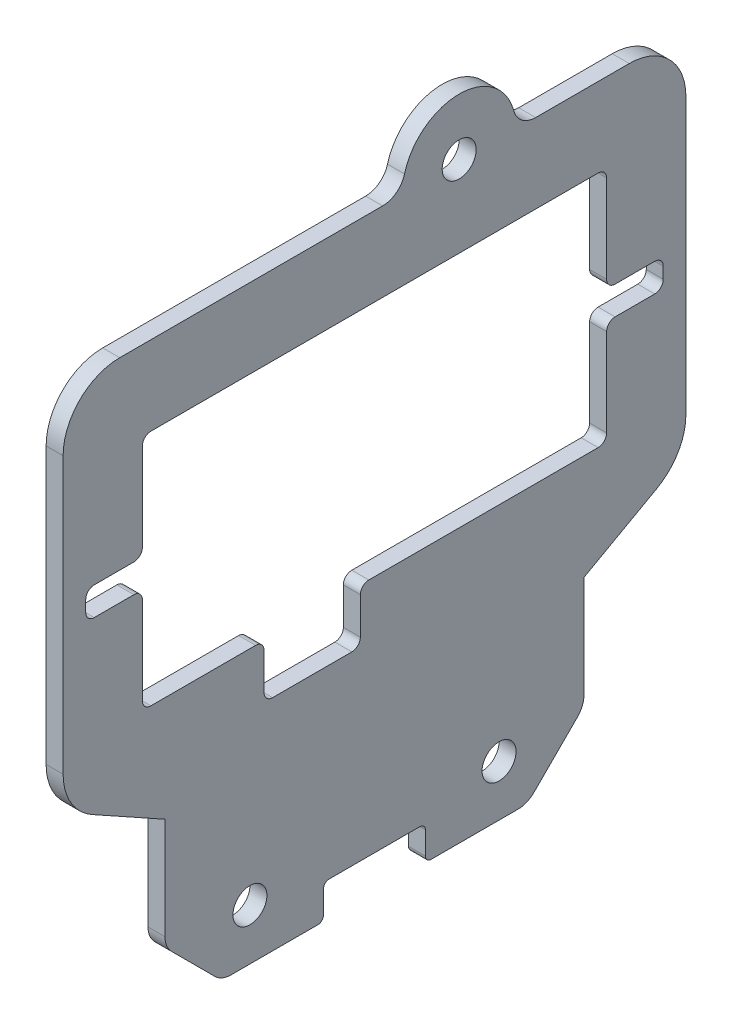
ISO-10303-21;
HEADER;
FILE_DESCRIPTION(('STEP AP214'),'2;1');
FILE_NAME('part.step','',(''),(''),'','','');
FILE_SCHEMA(('AUTOMOTIVE_DESIGN { 1 0 10303 214 1 1 1 1 }'));
ENDSEC;
DATA;
#1=APPLICATION_CONTEXT('core data for automotive mechanical design processes');
#2=APPLICATION_PROTOCOL_DEFINITION('international standard','automotive_design',2000,#1);
#3=PRODUCT_CONTEXT('',#1,'mechanical');
#4=PRODUCT('Part','Part','',(#3));
#5=PRODUCT_RELATED_PRODUCT_CATEGORY('part','',(#4));
#6=PRODUCT_DEFINITION_FORMATION('','',#4);
#7=PRODUCT_DEFINITION_CONTEXT('part definition',#1,'design');
#8=PRODUCT_DEFINITION('design','',#6,#7);
#9=PRODUCT_DEFINITION_SHAPE('','',#8);
#10=(LENGTH_UNIT() NAMED_UNIT(*) SI_UNIT(.MILLI.,.METRE.));
#11=(NAMED_UNIT(*) PLANE_ANGLE_UNIT() SI_UNIT($,.RADIAN.));
#12=(NAMED_UNIT(*) SI_UNIT($,.STERADIAN.) SOLID_ANGLE_UNIT());
#13=UNCERTAINTY_MEASURE_WITH_UNIT(LENGTH_MEASURE(1.E-05),#10,'distance_accuracy_value','');
#14=(GEOMETRIC_REPRESENTATION_CONTEXT(3) GLOBAL_UNCERTAINTY_ASSIGNED_CONTEXT((#13)) GLOBAL_UNIT_ASSIGNED_CONTEXT((#10,
#11,#12)) REPRESENTATION_CONTEXT('',''));
#15=CARTESIAN_POINT('',(0.,0.,0.));
#16=DIRECTION('',(0.,0.,1.));
#17=DIRECTION('',(1.,0.,0.));
#18=AXIS2_PLACEMENT_3D('',#15,#16,#17);
#19=CARTESIAN_POINT('',(0.,-34.6199111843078,-18.5));
#20=DIRECTION('',(0.,1.,0.));
#21=DIRECTION('',(-1.,0.,0.));
#22=AXIS2_PLACEMENT_3D('',#19,#20,#21);
#23=PLANE('',#22);
#24=DIRECTION('',(0.,0.,-1.));
#25=VECTOR('',#24,1.);
#26=CARTESIAN_POINT('',(0.,-34.6199111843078,0.));
#27=LINE('',#26,#25);
#28=CARTESIAN_POINT('',(0.,-34.6199111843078,-5.));
#29=VERTEX_POINT('',#28);
#30=CARTESIAN_POINT('',(0.,-34.6199111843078,-12.6715728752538));
#31=VERTEX_POINT('',#30);
#32=EDGE_CURVE('E608',#29,#31,#27,.T.);
#33=ORIENTED_EDGE('',*,*,#32,.F.);
#34=DIRECTION('',(-1.,0.,0.));
#35=VECTOR('',#34,1.);
#36=CARTESIAN_POINT('',(0.,-34.6199111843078,-5.));
#37=LINE('',#36,#35);
#38=CARTESIAN_POINT('',(-1.49999999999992,-34.6199111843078,-5.));
#39=VERTEX_POINT('',#38);
#40=EDGE_CURVE('E713',#29,#39,#37,.T.);
#41=ORIENTED_EDGE('',*,*,#40,.T.);
#42=DIRECTION('',(0.,0.,1.));
#43=VECTOR('',#42,1.);
#44=CARTESIAN_POINT('',(-1.49999999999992,-34.6199111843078,-18.5));
#45=LINE('',#44,#43);
#46=CARTESIAN_POINT('',(-1.49999999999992,-34.6199111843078,-12.6715728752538));
#47=VERTEX_POINT('',#46);
#48=EDGE_CURVE('E620',#39,#47,#45,.F.);
#49=ORIENTED_EDGE('',*,*,#48,.T.);
#50=DIRECTION('',(-1.,0.,0.));
#51=VECTOR('',#50,1.);
#52=CARTESIAN_POINT('',(0.,-34.6199111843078,-12.6715728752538));
#53=LINE('',#52,#51);
#54=EDGE_CURVE('E678',#47,#31,#53,.F.);
#55=ORIENTED_EDGE('',*,*,#54,.T.);
#56=EDGE_LOOP('',(#33,#41,#49,#55));
#57=FACE_BOUND('',#56,.T.);
#58=ADVANCED_FACE('F69',(#57),#23,.F.);
#59=CARTESIAN_POINT('',(0.,-34.6199111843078,18.5));
#60=DIRECTION('',(0.,0.,-1.));
#61=DIRECTION('',(0.,-1.,0.));
#62=AXIS2_PLACEMENT_3D('',#59,#60,#61);
#63=PLANE('',#62);
#64=DIRECTION('',(0.,1.,0.));
#65=VECTOR('',#64,1.);
#66=CARTESIAN_POINT('',(-1.49999999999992,-34.6199111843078,18.5));
#67=LINE('',#66,#65);
#68=CARTESIAN_POINT('',(-1.5,-19.8,18.5));
#69=VERTEX_POINT('',#68);
#70=CARTESIAN_POINT('',(-1.49999999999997,-28.7914840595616,18.5));
#71=VERTEX_POINT('',#70);
#72=EDGE_CURVE('E594',#69,#71,#67,.F.);
#73=ORIENTED_EDGE('',*,*,#72,.T.);
#74=DIRECTION('',(-1.,0.,0.));
#75=VECTOR('',#74,1.);
#76=CARTESIAN_POINT('',(0.,-28.7914840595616,18.5));
#77=LINE('',#76,#75);
#78=CARTESIAN_POINT('',(0.,-28.7914840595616,18.5));
#79=VERTEX_POINT('',#78);
#80=EDGE_CURVE('E639',#71,#79,#77,.F.);
#81=ORIENTED_EDGE('',*,*,#80,.T.);
#82=DIRECTION('',(0.,-1.,0.));
#83=VECTOR('',#82,1.);
#84=CARTESIAN_POINT('',(0.,-20.6199111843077,18.5));
#85=LINE('',#84,#83);
#86=CARTESIAN_POINT('',(0.,-19.8,18.5));
#87=VERTEX_POINT('',#86);
#88=EDGE_CURVE('E609',#87,#79,#85,.T.);
#89=ORIENTED_EDGE('',*,*,#88,.F.);
#90=DIRECTION('',(1.,0.,0.));
#91=VECTOR('',#90,1.);
#92=CARTESIAN_POINT('',(-1.501,-19.8,18.5));
#93=LINE('',#92,#91);
#94=EDGE_CURVE('E1137',#69,#87,#93,.T.);
#95=ORIENTED_EDGE('',*,*,#94,.F.);
#96=EDGE_LOOP('',(#73,#81,#89,#95));
#97=FACE_BOUND('',#96,.T.);
#98=ADVANCED_FACE('F1157',(#97),#63,.F.);
#99=CARTESIAN_POINT('',(0.,-22.1199111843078,-18.5));
#100=DIRECTION('',(0.,0.,1.));
#101=DIRECTION('',(0.,1.,0.));
#102=AXIS2_PLACEMENT_3D('',#99,#100,#101);
#103=PLANE('',#102);
#104=DIRECTION('',(0.,1.,0.));
#105=VECTOR('',#104,1.);
#106=CARTESIAN_POINT('',(0.,-20.6199111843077,-18.5));
#107=LINE('',#106,#105);
#108=CARTESIAN_POINT('',(0.,-28.7914840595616,-18.5));
#109=VERTEX_POINT('',#108);
#110=CARTESIAN_POINT('',(0.,-19.8,-18.5));
#111=VERTEX_POINT('',#110);
#112=EDGE_CURVE('E601',#109,#111,#107,.T.);
#113=ORIENTED_EDGE('',*,*,#112,.F.);
#114=DIRECTION('',(1.,0.,0.));
#115=VECTOR('',#114,1.);
#116=CARTESIAN_POINT('',(-1.49999999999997,-28.7914840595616,-18.5));
#117=LINE('',#116,#115);
#118=CARTESIAN_POINT('',(-1.49999999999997,-28.7914840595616,-18.5));
#119=VERTEX_POINT('',#118);
#120=EDGE_CURVE('E688',#109,#119,#117,.F.);
#121=ORIENTED_EDGE('',*,*,#120,.T.);
#122=DIRECTION('',(0.,-1.,0.));
#123=VECTOR('',#122,1.);
#124=CARTESIAN_POINT('',(-1.50000000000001,-22.1199111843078,-18.5));
#125=LINE('',#124,#123);
#126=CARTESIAN_POINT('',(-1.5,-19.8,-18.5));
#127=VERTEX_POINT('',#126);
#128=EDGE_CURVE('E613',#119,#127,#125,.F.);
#129=ORIENTED_EDGE('',*,*,#128,.T.);
#130=DIRECTION('',(1.,0.,0.));
#131=VECTOR('',#130,1.);
#132=CARTESIAN_POINT('',(-1.501,-19.8,-18.5));
#133=LINE('',#132,#131);
#134=EDGE_CURVE('E469',#127,#111,#133,.T.);
#135=ORIENTED_EDGE('',*,*,#134,.T.);
#136=EDGE_LOOP('',(#113,#121,#129,#135));
#137=FACE_BOUND('',#136,.T.);
#138=ADVANCED_FACE('F1201',(#137),#103,.F.);
#139=CARTESIAN_POINT('',(0.,0.,0.));
#140=DIRECTION('',(1.,0.,0.));
#141=DIRECTION('',(0.,0.,-1.));
#142=AXIS2_PLACEMENT_3D('',#139,#140,#141);
#143=PLANE('',#142);
#144=CARTESIAN_POINT('',(0.,-30.1199111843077,-11.));
#145=DIRECTION('',(-1.,0.,0.));
#146=DIRECTION('',(0.,-1.,0.));
#147=AXIS2_PLACEMENT_3D('',#144,#145,#146);
#148=CIRCLE('',#147,1.5);
#149=CARTESIAN_POINT('',(0.,-31.6199111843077,-11.));
#150=VERTEX_POINT('',#149);
#151=EDGE_CURVE('E589',#150,#150,#148,.F.);
#152=ORIENTED_EDGE('',*,*,#151,.F.);
#153=EDGE_LOOP('',(#152));
#154=FACE_BOUND('',#153,.T.);
#155=CARTESIAN_POINT('',(0.,-30.1199111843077,11.));
#156=DIRECTION('',(-1.,0.,0.));
#157=DIRECTION('',(0.,-1.,0.));
#158=AXIS2_PLACEMENT_3D('',#155,#156,#157);
#159=CIRCLE('',#158,1.5);
#160=CARTESIAN_POINT('',(0.,-31.6199111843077,11.));
#161=VERTEX_POINT('',#160);
#162=EDGE_CURVE('E584',#161,#161,#159,.F.);
#163=ORIENTED_EDGE('',*,*,#162,.F.);
#164=EDGE_LOOP('',(#163));
#165=FACE_BOUND('',#164,.T.);
#166=CARTESIAN_POINT('',(0.,-34.6199111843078,12.6715728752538));
#167=VERTEX_POINT('',#166);
#168=CARTESIAN_POINT('',(0.,-34.6199111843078,5.));
#169=VERTEX_POINT('',#168);
#170=EDGE_CURVE('E605',#167,#169,#27,.T.);
#171=ORIENTED_EDGE('',*,*,#170,.T.);
#172=CARTESIAN_POINT('',(0.,-34.1199111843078,5.));
#173=DIRECTION('',(-1.,0.,0.));
#174=DIRECTION('',(0.,-1.,0.));
#175=AXIS2_PLACEMENT_3D('',#172,#173,#174);
#176=CIRCLE('',#175,0.5);
#177=CARTESIAN_POINT('',(0.,-34.1199111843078,4.5));
#178=VERTEX_POINT('',#177);
#179=EDGE_CURVE('E710',#169,#178,#176,.F.);
#180=ORIENTED_EDGE('',*,*,#179,.T.);
#181=DIRECTION('',(0.,-1.,0.));
#182=VECTOR('',#181,1.);
#183=CARTESIAN_POINT('',(0.,-34.6199111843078,4.5));
#184=LINE('',#183,#182);
#185=CARTESIAN_POINT('',(0.,-32.1199111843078,4.5));
#186=VERTEX_POINT('',#185);
#187=EDGE_CURVE('E580',#186,#178,#184,.T.);
#188=ORIENTED_EDGE('',*,*,#187,.F.);
#189=CARTESIAN_POINT('',(0.,-32.1199111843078,4.));
#190=DIRECTION('',(-1.,0.,0.));
#191=DIRECTION('',(0.,-1.,0.));
#192=AXIS2_PLACEMENT_3D('',#189,#190,#191);
#193=CIRCLE('',#192,0.5);
#194=CARTESIAN_POINT('',(0.,-31.6199111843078,4.));
#195=VERTEX_POINT('',#194);
#196=EDGE_CURVE('E734',#186,#195,#193,.T.);
#197=ORIENTED_EDGE('',*,*,#196,.T.);
#198=DIRECTION('',(0.,0.,1.));
#199=VECTOR('',#198,1.);
#200=CARTESIAN_POINT('',(0.,-31.6199111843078,-4.5));
#201=LINE('',#200,#199);
#202=CARTESIAN_POINT('',(0.,-31.6199111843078,-4.));
#203=VERTEX_POINT('',#202);
#204=EDGE_CURVE('E561',#203,#195,#201,.T.);
#205=ORIENTED_EDGE('',*,*,#204,.F.);
#206=CARTESIAN_POINT('',(0.,-32.1199111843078,-4.));
#207=DIRECTION('',(-1.,0.,0.));
#208=DIRECTION('',(0.,-1.,0.));
#209=AXIS2_PLACEMENT_3D('',#206,#207,#208);
#210=CIRCLE('',#209,0.5);
#211=CARTESIAN_POINT('',(0.,-32.1199111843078,-4.5));
#212=VERTEX_POINT('',#211);
#213=EDGE_CURVE('E13',#203,#212,#210,.T.);
#214=ORIENTED_EDGE('',*,*,#213,.T.);
#215=DIRECTION('',(0.,1.,0.));
#216=VECTOR('',#215,1.);
#217=CARTESIAN_POINT('',(0.,-34.6199111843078,-4.5));
#218=LINE('',#217,#216);
#219=CARTESIAN_POINT('',(0.,-34.1199111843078,-4.5));
#220=VERTEX_POINT('',#219);
#221=EDGE_CURVE('E565',#220,#212,#218,.T.);
#222=ORIENTED_EDGE('',*,*,#221,.F.);
#223=CARTESIAN_POINT('',(0.,-34.1199111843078,-5.));
#224=DIRECTION('',(-1.,0.,0.));
#225=DIRECTION('',(0.,-1.,0.));
#226=AXIS2_PLACEMENT_3D('',#223,#224,#225);
#227=CIRCLE('',#226,0.5);
#228=EDGE_CURVE('E85',#220,#29,#227,.F.);
#229=ORIENTED_EDGE('',*,*,#228,.T.);
#230=ORIENTED_EDGE('',*,*,#32,.T.);
#231=CARTESIAN_POINT('',(0.,-32.6199111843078,-12.6715728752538));
#232=DIRECTION('',(-1.,0.,0.));
#233=DIRECTION('',(0.,-1.,0.));
#234=AXIS2_PLACEMENT_3D('',#231,#232,#233);
#235=CIRCLE('',#234,2.);
#236=CARTESIAN_POINT('',(0.,-34.0341247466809,-14.0857864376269));
#237=VERTEX_POINT('',#236);
#238=EDGE_CURVE('E646',#31,#237,#235,.F.);
#239=ORIENTED_EDGE('',*,*,#238,.T.);
#240=DIRECTION('',(0.,-0.707106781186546,0.707106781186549));
#241=VECTOR('',#240,1.);
#242=CARTESIAN_POINT('',(0.,-29.6199111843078,-18.5));
#243=LINE('',#242,#241);
#244=CARTESIAN_POINT('',(0.,-30.2056976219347,-17.9142135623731));
#245=VERTEX_POINT('',#244);
#246=EDGE_CURVE('E631',#237,#245,#243,.F.);
#247=ORIENTED_EDGE('',*,*,#246,.T.);
#248=CARTESIAN_POINT('',(0.,-28.7914840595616,-16.5));
#249=DIRECTION('',(-1.,0.,0.));
#250=DIRECTION('',(0.,-1.,0.));
#251=AXIS2_PLACEMENT_3D('',#248,#249,#250);
#252=CIRCLE('',#251,2.);
#253=EDGE_CURVE('E643',#245,#109,#252,.F.);
#254=ORIENTED_EDGE('',*,*,#253,.T.);
#255=ORIENTED_EDGE('',*,*,#112,.T.);
#256=DIRECTION('',(0.,-0.485642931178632,0.874157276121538));
#257=VECTOR('',#256,1.);
#258=CARTESIAN_POINT('',(0.,-14.8,-27.5));
#259=LINE('',#258,#257);
#260=CARTESIAN_POINT('',(0.,-16.2287696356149,-24.9282146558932));
#261=VERTEX_POINT('',#260);
#262=EDGE_CURVE('E541',#261,#111,#259,.T.);
#263=ORIENTED_EDGE('',*,*,#262,.F.);
#264=CARTESIAN_POINT('',(0.,-11.8579832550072,-22.5));
#265=DIRECTION('',(1.,0.,0.));
#266=DIRECTION('',(0.,0.,-1.));
#267=AXIS2_PLACEMENT_3D('',#264,#265,#266);
#268=CIRCLE('',#267,5.);
#269=CARTESIAN_POINT('',(0.,-11.8579832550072,-27.5));
#270=VERTEX_POINT('',#269);
#271=EDGE_CURVE('E786',#261,#270,#268,.T.);
#272=ORIENTED_EDGE('',*,*,#271,.T.);
#273=DIRECTION('',(0.,1.,0.));
#274=VECTOR('',#273,1.);
#275=CARTESIAN_POINT('',(0.,17.5,-27.5));
#276=LINE('',#275,#274);
#277=CARTESIAN_POINT('',(0.,12.5,-27.5));
#278=VERTEX_POINT('',#277);
#279=EDGE_CURVE('E782',#270,#278,#276,.T.);
#280=ORIENTED_EDGE('',*,*,#279,.T.);
#281=CARTESIAN_POINT('',(0.,12.5,-22.5));
#282=DIRECTION('',(1.,0.,0.));
#283=DIRECTION('',(0.,0.,-1.));
#284=AXIS2_PLACEMENT_3D('',#281,#282,#283);
#285=CIRCLE('',#284,5.);
#286=CARTESIAN_POINT('',(0.,17.5,-22.5));
#287=VERTEX_POINT('',#286);
#288=EDGE_CURVE('E780',#278,#287,#285,.T.);
#289=ORIENTED_EDGE('',*,*,#288,.T.);
#290=DIRECTION('',(0.,0.,1.));
#291=VECTOR('',#290,1.);
#292=CARTESIAN_POINT('',(0.,17.5,27.5));
#293=LINE('',#292,#291);
#294=CARTESIAN_POINT('',(0.,17.5,-14.236301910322));
#295=VERTEX_POINT('',#294);
#296=EDGE_CURVE('E768',#287,#295,#293,.T.);
#297=ORIENTED_EDGE('',*,*,#296,.T.);
#298=CARTESIAN_POINT('',(0.,19.5,-14.236301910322));
#299=DIRECTION('',(1.,0.,0.));
#300=DIRECTION('',(0.,0.,-1.));
#301=AXIS2_PLACEMENT_3D('',#298,#299,#300);
#302=CIRCLE('',#301,2.);
#303=CARTESIAN_POINT('',(0.,18.9793341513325,-12.3052640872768));
#304=VERTEX_POINT('',#303);
#305=EDGE_CURVE('E774',#295,#304,#302,.F.);
#306=ORIENTED_EDGE('',*,*,#305,.T.);
#307=CARTESIAN_POINT('',(0.,17.6776695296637,-7.47766952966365));
#308=DIRECTION('',(1.,0.,0.));
#309=DIRECTION('',(0.,0.,1.));
#310=AXIS2_PLACEMENT_3D('',#307,#308,#309);
#311=CIRCLE('',#310,5.);
#312=CARTESIAN_POINT('',(0.,18.9793341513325,-2.65007497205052));
#313=VERTEX_POINT('',#312);
#314=EDGE_CURVE('E770',#304,#313,#311,.T.);
#315=ORIENTED_EDGE('',*,*,#314,.T.);
#316=CARTESIAN_POINT('',(0.,19.5,-0.71903714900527));
#317=DIRECTION('',(1.,0.,0.));
#318=DIRECTION('',(0.,0.,-1.));
#319=AXIS2_PLACEMENT_3D('',#316,#317,#318);
#320=CIRCLE('',#319,2.);
#321=CARTESIAN_POINT('',(0.,17.5,-0.719037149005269));
#322=VERTEX_POINT('',#321);
#323=EDGE_CURVE('E766',#313,#322,#320,.F.);
#324=ORIENTED_EDGE('',*,*,#323,.T.);
#325=CARTESIAN_POINT('',(0.,17.5,22.5));
#326=VERTEX_POINT('',#325);
#327=EDGE_CURVE('E463',#322,#326,#293,.T.);
#328=ORIENTED_EDGE('',*,*,#327,.T.);
#329=CARTESIAN_POINT('',(0.,12.5,22.5));
#330=DIRECTION('',(1.,0.,0.));
#331=DIRECTION('',(0.,0.,-1.));
#332=AXIS2_PLACEMENT_3D('',#329,#330,#331);
#333=CIRCLE('',#332,5.);
#334=CARTESIAN_POINT('',(0.,12.5,27.5));
#335=VERTEX_POINT('',#334);
#336=EDGE_CURVE('E457',#326,#335,#333,.T.);
#337=ORIENTED_EDGE('',*,*,#336,.T.);
#338=DIRECTION('',(0.,-1.,0.));
#339=VECTOR('',#338,1.);
#340=CARTESIAN_POINT('',(0.,17.5,27.5));
#341=LINE('',#340,#339);
#342=CARTESIAN_POINT('',(0.,-11.8579832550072,27.5));
#343=VERTEX_POINT('',#342);
#344=EDGE_CURVE('E461',#335,#343,#341,.T.);
#345=ORIENTED_EDGE('',*,*,#344,.T.);
#346=CARTESIAN_POINT('',(0.,-11.8579832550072,22.5));
#347=DIRECTION('',(1.,0.,0.));
#348=DIRECTION('',(0.,0.,-1.));
#349=AXIS2_PLACEMENT_3D('',#346,#347,#348);
#350=CIRCLE('',#349,5.);
#351=CARTESIAN_POINT('',(0.,-16.2287696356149,24.9282146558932));
#352=VERTEX_POINT('',#351);
#353=EDGE_CURVE('E480',#343,#352,#350,.T.);
#354=ORIENTED_EDGE('',*,*,#353,.T.);
#355=DIRECTION('',(0.,0.485642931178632,0.874157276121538));
#356=VECTOR('',#355,1.);
#357=CARTESIAN_POINT('',(0.,-14.8,27.5));
#358=LINE('',#357,#356);
#359=EDGE_CURVE('E488',#87,#352,#358,.T.);
#360=ORIENTED_EDGE('',*,*,#359,.F.);
#361=ORIENTED_EDGE('',*,*,#88,.T.);
#362=CARTESIAN_POINT('',(0.,-28.7914840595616,16.5));
#363=DIRECTION('',(-1.,0.,0.));
#364=DIRECTION('',(0.,-1.,0.));
#365=AXIS2_PLACEMENT_3D('',#362,#363,#364);
#366=CIRCLE('',#365,2.);
#367=CARTESIAN_POINT('',(0.,-30.2056976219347,17.9142135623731));
#368=VERTEX_POINT('',#367);
#369=EDGE_CURVE('E652',#79,#368,#366,.F.);
#370=ORIENTED_EDGE('',*,*,#369,.T.);
#371=DIRECTION('',(0.,0.707106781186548,0.707106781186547));
#372=VECTOR('',#371,1.);
#373=CARTESIAN_POINT('',(0.,-34.6199111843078,13.5));
#374=LINE('',#373,#372);
#375=CARTESIAN_POINT('',(0.,-34.0341247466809,14.0857864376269));
#376=VERTEX_POINT('',#375);
#377=EDGE_CURVE('E635',#368,#376,#374,.F.);
#378=ORIENTED_EDGE('',*,*,#377,.T.);
#379=CARTESIAN_POINT('',(0.,-32.6199111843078,12.6715728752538));
#380=DIRECTION('',(-1.,0.,0.));
#381=DIRECTION('',(0.,-1.,0.));
#382=AXIS2_PLACEMENT_3D('',#379,#380,#381);
#383=CIRCLE('',#382,2.);
#384=EDGE_CURVE('E649',#376,#167,#383,.F.);
#385=ORIENTED_EDGE('',*,*,#384,.T.);
#386=EDGE_LOOP('',(#171,#180,#188,#197,#205,#214,#222,#229,#230,#239,#247,#254,#255,#263,#272,
#280,#289,#297,#306,#315,#324,#328,#337,#345,#354,#360,#361,#370,#378,#385));
#387=FACE_BOUND('',#386,.T.);
#388=DIRECTION('',(0.,0.,-1.));
#389=VECTOR('',#388,1.);
#390=CARTESIAN_POINT('',(0.,-10.5,-20.5));
#391=LINE('',#390,#389);
#392=CARTESIAN_POINT('',(0.,-10.5,0.5));
#393=VERTEX_POINT('',#392);
#394=CARTESIAN_POINT('',(0.,-10.5,-19.75));
#395=VERTEX_POINT('',#394);
#396=EDGE_CURVE('E946',#393,#395,#391,.T.);
#397=ORIENTED_EDGE('',*,*,#396,.F.);
#398=CARTESIAN_POINT('',(0.,-11.25,0.5));
#399=DIRECTION('',(1.,0.,0.));
#400=DIRECTION('',(0.,0.,-1.));
#401=AXIS2_PLACEMENT_3D('',#398,#399,#400);
#402=CIRCLE('',#401,0.75);
#403=CARTESIAN_POINT('',(0.,-11.25,1.25));
#404=VERTEX_POINT('',#403);
#405=EDGE_CURVE('E835',#393,#404,#402,.T.);
#406=ORIENTED_EDGE('',*,*,#405,.T.);
#407=DIRECTION('',(0.,1.,0.));
#408=VECTOR('',#407,1.);
#409=CARTESIAN_POINT('',(0.,-10.5,1.25));
#410=LINE('',#409,#408);
#411=CARTESIAN_POINT('',(0.,-14.5,1.25));
#412=VERTEX_POINT('',#411);
#413=EDGE_CURVE('E931',#412,#404,#410,.T.);
#414=ORIENTED_EDGE('',*,*,#413,.F.);
#415=CARTESIAN_POINT('',(0.,-14.5,2.));
#416=DIRECTION('',(1.,0.,0.));
#417=DIRECTION('',(0.,0.,-1.));
#418=AXIS2_PLACEMENT_3D('',#415,#416,#417);
#419=CIRCLE('',#418,0.75);
#420=CARTESIAN_POINT('',(0.,-15.25,2.));
#421=VERTEX_POINT('',#420);
#422=EDGE_CURVE('E832',#412,#421,#419,.F.);
#423=ORIENTED_EDGE('',*,*,#422,.T.);
#424=DIRECTION('',(0.,0.,-1.));
#425=VECTOR('',#424,1.);
#426=CARTESIAN_POINT('',(0.,-15.25,9.75));
#427=LINE('',#426,#425);
#428=CARTESIAN_POINT('',(0.,-15.25,9.));
#429=VERTEX_POINT('',#428);
#430=EDGE_CURVE('E1133',#429,#421,#427,.T.);
#431=ORIENTED_EDGE('',*,*,#430,.F.);
#432=CARTESIAN_POINT('',(0.,-14.5,9.));
#433=DIRECTION('',(1.,0.,0.));
#434=DIRECTION('',(0.,0.,-1.));
#435=AXIS2_PLACEMENT_3D('',#432,#433,#434);
#436=CIRCLE('',#435,0.75);
#437=CARTESIAN_POINT('',(0.,-14.5,9.75));
#438=VERTEX_POINT('',#437);
#439=EDGE_CURVE('E829',#429,#438,#436,.F.);
#440=ORIENTED_EDGE('',*,*,#439,.T.);
#441=DIRECTION('',(0.,-1.,0.));
#442=VECTOR('',#441,1.);
#443=CARTESIAN_POINT('',(0.,-10.5,9.75));
#444=LINE('',#443,#442);
#445=CARTESIAN_POINT('',(0.,-11.25,9.75));
#446=VERTEX_POINT('',#445);
#447=EDGE_CURVE('E1118',#446,#438,#444,.T.);
#448=ORIENTED_EDGE('',*,*,#447,.F.);
#449=CARTESIAN_POINT('',(0.,-11.25,10.5));
#450=DIRECTION('',(1.,0.,0.));
#451=DIRECTION('',(0.,0.,-1.));
#452=AXIS2_PLACEMENT_3D('',#449,#450,#451);
#453=CIRCLE('',#452,0.75);
#454=CARTESIAN_POINT('',(0.,-10.5,10.5));
#455=VERTEX_POINT('',#454);
#456=EDGE_CURVE('E826',#446,#455,#453,.T.);
#457=ORIENTED_EDGE('',*,*,#456,.T.);
#458=CARTESIAN_POINT('',(0.,-10.5,19.75));
#459=VERTEX_POINT('',#458);
#460=EDGE_CURVE('E952',#459,#455,#391,.T.);
#461=ORIENTED_EDGE('',*,*,#460,.F.);
#462=CARTESIAN_POINT('',(0.,-9.75,19.75));
#463=DIRECTION('',(1.,0.,0.));
#464=DIRECTION('',(0.,0.,-1.));
#465=AXIS2_PLACEMENT_3D('',#462,#463,#464);
#466=CIRCLE('',#465,0.75);
#467=CARTESIAN_POINT('',(0.,-9.75,20.5));
#468=VERTEX_POINT('',#467);
#469=EDGE_CURVE('E823',#459,#468,#466,.F.);
#470=ORIENTED_EDGE('',*,*,#469,.T.);
#471=DIRECTION('',(0.,-1.,0.));
#472=VECTOR('',#471,1.);
#473=CARTESIAN_POINT('',(0.,-10.5,20.5));
#474=LINE('',#473,#472);
#475=CARTESIAN_POINT('',(0.,-2.,20.5));
#476=VERTEX_POINT('',#475);
#477=EDGE_CURVE('E1041',#476,#468,#474,.T.);
#478=ORIENTED_EDGE('',*,*,#477,.F.);
#479=CARTESIAN_POINT('',(0.,-2.,21.25));
#480=DIRECTION('',(1.,0.,0.));
#481=DIRECTION('',(0.,0.,-1.));
#482=AXIS2_PLACEMENT_3D('',#479,#480,#481);
#483=CIRCLE('',#482,0.75);
#484=CARTESIAN_POINT('',(0.,-1.25,21.25));
#485=VERTEX_POINT('',#484);
#486=EDGE_CURVE('E820',#476,#485,#483,.T.);
#487=ORIENTED_EDGE('',*,*,#486,.T.);
#488=DIRECTION('',(0.,0.,-1.));
#489=VECTOR('',#488,1.);
#490=CARTESIAN_POINT('',(0.,-1.25,-25.5));
#491=LINE('',#490,#489);
#492=CARTESIAN_POINT('',(0.,-1.25,24.75));
#493=VERTEX_POINT('',#492);
#494=EDGE_CURVE('E1078',#493,#485,#491,.T.);
#495=ORIENTED_EDGE('',*,*,#494,.F.);
#496=CARTESIAN_POINT('',(0.,-0.5,24.75));
#497=DIRECTION('',(1.,0.,0.));
#498=DIRECTION('',(0.,0.,-1.));
#499=AXIS2_PLACEMENT_3D('',#496,#497,#498);
#500=CIRCLE('',#499,0.75);
#501=CARTESIAN_POINT('',(0.,-0.5,25.5));
#502=VERTEX_POINT('',#501);
#503=EDGE_CURVE('E817',#493,#502,#500,.F.);
#504=ORIENTED_EDGE('',*,*,#503,.T.);
#505=DIRECTION('',(0.,-1.,0.));
#506=VECTOR('',#505,1.);
#507=CARTESIAN_POINT('',(0.,-1.25,25.5));
#508=LINE('',#507,#506);
#509=CARTESIAN_POINT('',(0.,0.5,25.5));
#510=VERTEX_POINT('',#509);
#511=EDGE_CURVE('E1062',#510,#502,#508,.T.);
#512=ORIENTED_EDGE('',*,*,#511,.F.);
#513=CARTESIAN_POINT('',(0.,0.5,24.75));
#514=DIRECTION('',(1.,0.,0.));
#515=DIRECTION('',(0.,0.,-1.));
#516=AXIS2_PLACEMENT_3D('',#513,#514,#515);
#517=CIRCLE('',#516,0.75);
#518=CARTESIAN_POINT('',(0.,1.25,24.75));
#519=VERTEX_POINT('',#518);
#520=EDGE_CURVE('E814',#510,#519,#517,.F.);
#521=ORIENTED_EDGE('',*,*,#520,.T.);
#522=DIRECTION('',(0.,0.,1.));
#523=VECTOR('',#522,1.);
#524=CARTESIAN_POINT('',(0.,1.25,-25.5));
#525=LINE('',#524,#523);
#526=CARTESIAN_POINT('',(0.,1.25,21.25));
#527=VERTEX_POINT('',#526);
#528=EDGE_CURVE('E1055',#527,#519,#525,.T.);
#529=ORIENTED_EDGE('',*,*,#528,.F.);
#530=CARTESIAN_POINT('',(0.,2.,21.25));
#531=DIRECTION('',(1.,0.,0.));
#532=DIRECTION('',(0.,0.,-1.));
#533=AXIS2_PLACEMENT_3D('',#530,#531,#532);
#534=CIRCLE('',#533,0.75);
#535=CARTESIAN_POINT('',(0.,2.,20.5));
#536=VERTEX_POINT('',#535);
#537=EDGE_CURVE('E811',#527,#536,#534,.T.);
#538=ORIENTED_EDGE('',*,*,#537,.T.);
#539=CARTESIAN_POINT('',(0.,9.74999999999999,20.5));
#540=VERTEX_POINT('',#539);
#541=EDGE_CURVE('E1035',#540,#536,#474,.T.);
#542=ORIENTED_EDGE('',*,*,#541,.F.);
#543=CARTESIAN_POINT('',(0.,9.75,19.75));
#544=DIRECTION('',(1.,0.,0.));
#545=DIRECTION('',(0.,0.,-1.));
#546=AXIS2_PLACEMENT_3D('',#543,#544,#545);
#547=CIRCLE('',#546,0.75);
#548=CARTESIAN_POINT('',(0.,10.5,19.75));
#549=VERTEX_POINT('',#548);
#550=EDGE_CURVE('E808',#540,#549,#547,.F.);
#551=ORIENTED_EDGE('',*,*,#550,.T.);
#552=DIRECTION('',(0.,0.,1.));
#553=VECTOR('',#552,1.);
#554=CARTESIAN_POINT('',(0.,10.5,-20.5));
#555=LINE('',#554,#553);
#556=CARTESIAN_POINT('',(0.,10.5,-19.75));
#557=VERTEX_POINT('',#556);
#558=EDGE_CURVE('E1024',#557,#549,#555,.T.);
#559=ORIENTED_EDGE('',*,*,#558,.F.);
#560=CARTESIAN_POINT('',(0.,9.75,-19.75));
#561=DIRECTION('',(1.,0.,0.));
#562=DIRECTION('',(0.,0.,-1.));
#563=AXIS2_PLACEMENT_3D('',#560,#561,#562);
#564=CIRCLE('',#563,0.75);
#565=CARTESIAN_POINT('',(0.,9.75000000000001,-20.5));
#566=VERTEX_POINT('',#565);
#567=EDGE_CURVE('E805',#557,#566,#564,.F.);
#568=ORIENTED_EDGE('',*,*,#567,.T.);
#569=DIRECTION('',(0.,1.,0.));
#570=VECTOR('',#569,1.);
#571=CARTESIAN_POINT('',(0.,-10.5,-20.5));
#572=LINE('',#571,#570);
#573=CARTESIAN_POINT('',(0.,2.,-20.5));
#574=VERTEX_POINT('',#573);
#575=EDGE_CURVE('E968',#574,#566,#572,.T.);
#576=ORIENTED_EDGE('',*,*,#575,.F.);
#577=CARTESIAN_POINT('',(0.,2.,-21.25));
#578=DIRECTION('',(1.,0.,0.));
#579=DIRECTION('',(0.,0.,-1.));
#580=AXIS2_PLACEMENT_3D('',#577,#578,#579);
#581=CIRCLE('',#580,0.75);
#582=CARTESIAN_POINT('',(0.,1.25,-21.25));
#583=VERTEX_POINT('',#582);
#584=EDGE_CURVE('E802',#574,#583,#581,.T.);
#585=ORIENTED_EDGE('',*,*,#584,.T.);
#586=DIRECTION('',(0.,0.,1.));
#587=VECTOR('',#586,1.);
#588=CARTESIAN_POINT('',(0.,1.25,-25.5));
#589=LINE('',#588,#587);
#590=CARTESIAN_POINT('',(0.,1.25,-24.75));
#591=VERTEX_POINT('',#590);
#592=EDGE_CURVE('E1009',#591,#583,#589,.T.);
#593=ORIENTED_EDGE('',*,*,#592,.F.);
#594=CARTESIAN_POINT('',(0.,0.5,-24.75));
#595=DIRECTION('',(1.,0.,0.));
#596=DIRECTION('',(0.,0.,-1.));
#597=AXIS2_PLACEMENT_3D('',#594,#595,#596);
#598=CIRCLE('',#597,0.75);
#599=CARTESIAN_POINT('',(0.,0.5,-25.5));
#600=VERTEX_POINT('',#599);
#601=EDGE_CURVE('E799',#591,#600,#598,.F.);
#602=ORIENTED_EDGE('',*,*,#601,.T.);
#603=DIRECTION('',(0.,1.,0.));
#604=VECTOR('',#603,1.);
#605=CARTESIAN_POINT('',(0.,-1.25,-25.5));
#606=LINE('',#605,#604);
#607=CARTESIAN_POINT('',(0.,-0.5,-25.5));
#608=VERTEX_POINT('',#607);
#609=EDGE_CURVE('E993',#608,#600,#606,.T.);
#610=ORIENTED_EDGE('',*,*,#609,.F.);
#611=CARTESIAN_POINT('',(0.,-0.5,-24.75));
#612=DIRECTION('',(1.,0.,0.));
#613=DIRECTION('',(0.,0.,-1.));
#614=AXIS2_PLACEMENT_3D('',#611,#612,#613);
#615=CIRCLE('',#614,0.75);
#616=CARTESIAN_POINT('',(0.,-1.25,-24.75));
#617=VERTEX_POINT('',#616);
#618=EDGE_CURVE('E796',#608,#617,#615,.F.);
#619=ORIENTED_EDGE('',*,*,#618,.T.);
#620=DIRECTION('',(0.,0.,-1.));
#621=VECTOR('',#620,1.);
#622=CARTESIAN_POINT('',(0.,-1.25,-25.5));
#623=LINE('',#622,#621);
#624=CARTESIAN_POINT('',(0.,-1.25,-21.25));
#625=VERTEX_POINT('',#624);
#626=EDGE_CURVE('E970',#625,#617,#623,.T.);
#627=ORIENTED_EDGE('',*,*,#626,.F.);
#628=CARTESIAN_POINT('',(0.,-2.,-21.25));
#629=DIRECTION('',(1.,0.,0.));
#630=DIRECTION('',(0.,0.,-1.));
#631=AXIS2_PLACEMENT_3D('',#628,#629,#630);
#632=CIRCLE('',#631,0.75);
#633=CARTESIAN_POINT('',(0.,-2.,-20.5));
#634=VERTEX_POINT('',#633);
#635=EDGE_CURVE('E793',#625,#634,#632,.T.);
#636=ORIENTED_EDGE('',*,*,#635,.T.);
#637=CARTESIAN_POINT('',(0.,-9.75,-20.5));
#638=VERTEX_POINT('',#637);
#639=EDGE_CURVE('E962',#638,#634,#572,.T.);
#640=ORIENTED_EDGE('',*,*,#639,.F.);
#641=CARTESIAN_POINT('',(0.,-9.75,-19.75));
#642=DIRECTION('',(1.,0.,0.));
#643=DIRECTION('',(0.,0.,-1.));
#644=AXIS2_PLACEMENT_3D('',#641,#642,#643);
#645=CIRCLE('',#644,0.75);
#646=EDGE_CURVE('E481',#638,#395,#645,.F.);
#647=ORIENTED_EDGE('',*,*,#646,.T.);
#648=EDGE_LOOP('',(#397,#406,#414,#423,#431,#440,#448,#457,#461,#470,#478,#487,#495,#504,#512,
#521,#529,#538,#542,#551,#559,#568,#576,#585,#593,#602,#610,#619,#627,#636,#640,#647));
#649=FACE_BOUND('',#648,.T.);
#650=CARTESIAN_POINT('',(0.,17.6776695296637,-7.47766952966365));
#651=DIRECTION('',(1.,0.,0.));
#652=DIRECTION('',(0.,0.,-1.));
#653=AXIS2_PLACEMENT_3D('',#650,#651,#652);
#654=CIRCLE('',#653,1.5);
#655=CARTESIAN_POINT('',(0.,17.6776695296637,-8.97766952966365));
#656=VERTEX_POINT('',#655);
#657=EDGE_CURVE('E553',#656,#656,#654,.T.);
#658=ORIENTED_EDGE('',*,*,#657,.F.);
#659=EDGE_LOOP('',(#658));
#660=FACE_BOUND('',#659,.T.);
#661=ADVANCED_FACE('F71',(#154,#165,#387,#649,#660),#143,.T.);
#662=CARTESIAN_POINT('',(-1.50000000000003,-20.6199111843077,0.));
#663=DIRECTION('',(-1.,0.,0.));
#664=DIRECTION('',(0.,-1.,0.));
#665=AXIS2_PLACEMENT_3D('',#662,#663,#664);
#666=PLANE('',#665);
#667=DIRECTION('',(0.,1.,0.));
#668=VECTOR('',#667,1.);
#669=CARTESIAN_POINT('',(-1.49999999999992,-34.6199111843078,4.5));
#670=LINE('',#669,#668);
#671=CARTESIAN_POINT('',(-1.49999999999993,-34.1199111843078,4.5));
#672=VERTEX_POINT('',#671);
#673=CARTESIAN_POINT('',(-1.49999999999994,-32.1199111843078,4.5));
#674=VERTEX_POINT('',#673);
#675=EDGE_CURVE('E568',#672,#674,#670,.T.);
#676=ORIENTED_EDGE('',*,*,#675,.F.);
#677=CARTESIAN_POINT('',(-1.49999999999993,-34.1199111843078,5.));
#678=DIRECTION('',(-1.,0.,0.));
#679=DIRECTION('',(0.,-1.,0.));
#680=AXIS2_PLACEMENT_3D('',#677,#678,#679);
#681=CIRCLE('',#680,0.5);
#682=CARTESIAN_POINT('',(-1.49999999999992,-34.6199111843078,5.));
#683=VERTEX_POINT('',#682);
#684=EDGE_CURVE('E702',#672,#683,#681,.T.);
#685=ORIENTED_EDGE('',*,*,#684,.T.);
#686=CARTESIAN_POINT('',(-1.49999999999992,-34.6199111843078,12.6715728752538));
#687=VERTEX_POINT('',#686);
#688=EDGE_CURVE('E616',#687,#683,#45,.F.);
#689=ORIENTED_EDGE('',*,*,#688,.F.);
#690=CARTESIAN_POINT('',(-1.49999999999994,-32.6199111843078,12.6715728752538));
#691=DIRECTION('',(-1.,0.,0.));
#692=DIRECTION('',(0.,-1.,0.));
#693=AXIS2_PLACEMENT_3D('',#690,#691,#692);
#694=CIRCLE('',#693,2.);
#695=CARTESIAN_POINT('',(-1.49999999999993,-34.0341247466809,14.0857864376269));
#696=VERTEX_POINT('',#695);
#697=EDGE_CURVE('E668',#687,#696,#694,.T.);
#698=ORIENTED_EDGE('',*,*,#697,.T.);
#699=DIRECTION('',(0.,-0.707106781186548,-0.707106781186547));
#700=VECTOR('',#699,1.);
#701=CARTESIAN_POINT('',(-1.49999999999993,-34.3699111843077,13.7500000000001));
#702=LINE('',#701,#700);
#703=CARTESIAN_POINT('',(-1.49999999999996,-30.2056976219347,17.9142135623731));
#704=VERTEX_POINT('',#703);
#705=EDGE_CURVE('E627',#696,#704,#702,.F.);
#706=ORIENTED_EDGE('',*,*,#705,.T.);
#707=CARTESIAN_POINT('',(-1.49999999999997,-28.7914840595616,16.5));
#708=DIRECTION('',(-1.,0.,0.));
#709=DIRECTION('',(0.,-1.,0.));
#710=AXIS2_PLACEMENT_3D('',#707,#708,#709);
#711=CIRCLE('',#710,2.);
#712=EDGE_CURVE('E671',#704,#71,#711,.T.);
#713=ORIENTED_EDGE('',*,*,#712,.T.);
#714=ORIENTED_EDGE('',*,*,#72,.F.);
#715=DIRECTION('',(0.,-0.485642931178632,-0.874157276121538));
#716=VECTOR('',#715,1.);
#717=CARTESIAN_POINT('',(-1.5,-14.8,27.5));
#718=LINE('',#717,#716);
#719=CARTESIAN_POINT('',(-1.5,-16.2287696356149,24.9282146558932));
#720=VERTEX_POINT('',#719);
#721=EDGE_CURVE('E1141',#720,#69,#718,.T.);
#722=ORIENTED_EDGE('',*,*,#721,.F.);
#723=CARTESIAN_POINT('',(-1.5,-11.8579832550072,22.5));
#724=DIRECTION('',(1.,0.,0.));
#725=DIRECTION('',(0.,0.,-1.));
#726=AXIS2_PLACEMENT_3D('',#723,#724,#725);
#727=CIRCLE('',#726,5.);
#728=CARTESIAN_POINT('',(-1.5,-11.8579832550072,27.5));
#729=VERTEX_POINT('',#728);
#730=EDGE_CURVE('E852',#720,#729,#727,.F.);
#731=ORIENTED_EDGE('',*,*,#730,.T.);
#732=DIRECTION('',(0.,-1.,0.));
#733=VECTOR('',#732,1.);
#734=CARTESIAN_POINT('',(-1.5,17.5,27.5));
#735=LINE('',#734,#733);
#736=CARTESIAN_POINT('',(-1.5,12.5,27.5));
#737=VERTEX_POINT('',#736);
#738=EDGE_CURVE('E495',#737,#729,#735,.T.);
#739=ORIENTED_EDGE('',*,*,#738,.F.);
#740=CARTESIAN_POINT('',(-1.5,12.5,22.5));
#741=DIRECTION('',(1.,0.,0.));
#742=DIRECTION('',(0.,0.,-1.));
#743=AXIS2_PLACEMENT_3D('',#740,#741,#742);
#744=CIRCLE('',#743,5.);
#745=CARTESIAN_POINT('',(-1.5,17.5,22.5));
#746=VERTEX_POINT('',#745);
#747=EDGE_CURVE('E486',#737,#746,#744,.F.);
#748=ORIENTED_EDGE('',*,*,#747,.T.);
#749=DIRECTION('',(0.,0.,1.));
#750=VECTOR('',#749,1.);
#751=CARTESIAN_POINT('',(-1.5,17.5,27.5));
#752=LINE('',#751,#750);
#753=CARTESIAN_POINT('',(-1.5,17.5,-0.719037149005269));
#754=VERTEX_POINT('',#753);
#755=EDGE_CURVE('E504',#754,#746,#752,.T.);
#756=ORIENTED_EDGE('',*,*,#755,.F.);
#757=CARTESIAN_POINT('',(-1.5,19.5,-0.71903714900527));
#758=DIRECTION('',(1.,0.,0.));
#759=DIRECTION('',(0.,0.,-1.));
#760=AXIS2_PLACEMENT_3D('',#757,#758,#759);
#761=CIRCLE('',#760,2.);
#762=CARTESIAN_POINT('',(-1.5,18.9793341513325,-2.65007497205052));
#763=VERTEX_POINT('',#762);
#764=EDGE_CURVE('E847',#754,#763,#761,.T.);
#765=ORIENTED_EDGE('',*,*,#764,.T.);
#766=CARTESIAN_POINT('',(-1.5,17.6776695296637,-7.47766952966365));
#767=DIRECTION('',(1.,0.,0.));
#768=DIRECTION('',(0.,0.,1.));
#769=AXIS2_PLACEMENT_3D('',#766,#767,#768);
#770=CIRCLE('',#769,5.);
#771=CARTESIAN_POINT('',(-1.5,18.9793341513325,-12.3052640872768));
#772=VERTEX_POINT('',#771);
#773=EDGE_CURVE('E518',#772,#763,#770,.T.);
#774=ORIENTED_EDGE('',*,*,#773,.F.);
#775=CARTESIAN_POINT('',(-1.5,19.5,-14.236301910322));
#776=DIRECTION('',(1.,0.,0.));
#777=DIRECTION('',(0.,0.,-1.));
#778=AXIS2_PLACEMENT_3D('',#775,#776,#777);
#779=CIRCLE('',#778,2.);
#780=CARTESIAN_POINT('',(-1.5,17.5,-14.236301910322));
#781=VERTEX_POINT('',#780);
#782=EDGE_CURVE('E844',#772,#781,#779,.T.);
#783=ORIENTED_EDGE('',*,*,#782,.T.);
#784=CARTESIAN_POINT('',(-1.5,17.5,-22.5));
#785=VERTEX_POINT('',#784);
#786=EDGE_CURVE('E505',#785,#781,#752,.T.);
#787=ORIENTED_EDGE('',*,*,#786,.F.);
#788=CARTESIAN_POINT('',(-1.5,12.5,-22.5));
#789=DIRECTION('',(1.,0.,0.));
#790=DIRECTION('',(0.,0.,-1.));
#791=AXIS2_PLACEMENT_3D('',#788,#789,#790);
#792=CIRCLE('',#791,5.);
#793=CARTESIAN_POINT('',(-1.5,12.5,-27.5));
#794=VERTEX_POINT('',#793);
#795=EDGE_CURVE('E841',#785,#794,#792,.F.);
#796=ORIENTED_EDGE('',*,*,#795,.T.);
#797=DIRECTION('',(0.,1.,0.));
#798=VECTOR('',#797,1.);
#799=CARTESIAN_POINT('',(-1.5,17.5,-27.5));
#800=LINE('',#799,#798);
#801=CARTESIAN_POINT('',(-1.5,-11.8579832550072,-27.5));
#802=VERTEX_POINT('',#801);
#803=EDGE_CURVE('E534',#802,#794,#800,.T.);
#804=ORIENTED_EDGE('',*,*,#803,.F.);
#805=CARTESIAN_POINT('',(-1.5,-11.8579832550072,-22.5));
#806=DIRECTION('',(1.,0.,0.));
#807=DIRECTION('',(0.,0.,-1.));
#808=AXIS2_PLACEMENT_3D('',#805,#806,#807);
#809=CIRCLE('',#808,5.);
#810=CARTESIAN_POINT('',(-1.5,-16.2287696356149,-24.9282146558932));
#811=VERTEX_POINT('',#810);
#812=EDGE_CURVE('E838',#802,#811,#809,.F.);
#813=ORIENTED_EDGE('',*,*,#812,.T.);
#814=DIRECTION('',(0.,0.485642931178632,-0.874157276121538));
#815=VECTOR('',#814,1.);
#816=CARTESIAN_POINT('',(-1.5,-14.8,-27.5));
#817=LINE('',#816,#815);
#818=EDGE_CURVE('E549',#127,#811,#817,.T.);
#819=ORIENTED_EDGE('',*,*,#818,.F.);
#820=ORIENTED_EDGE('',*,*,#128,.F.);
#821=CARTESIAN_POINT('',(-1.49999999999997,-28.7914840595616,-16.5));
#822=DIRECTION('',(-1.,0.,0.));
#823=DIRECTION('',(0.,-1.,0.));
#824=AXIS2_PLACEMENT_3D('',#821,#822,#823);
#825=CIRCLE('',#824,2.);
#826=CARTESIAN_POINT('',(-1.49999999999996,-30.2056976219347,-17.9142135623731));
#827=VERTEX_POINT('',#826);
#828=EDGE_CURVE('E661',#119,#827,#825,.T.);
#829=ORIENTED_EDGE('',*,*,#828,.T.);
#830=DIRECTION('',(0.,0.707106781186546,-0.707106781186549));
#831=VECTOR('',#830,1.);
#832=CARTESIAN_POINT('',(-1.49999999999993,-34.3699111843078,-13.75));
#833=LINE('',#832,#831);
#834=CARTESIAN_POINT('',(-1.49999999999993,-34.0341247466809,-14.0857864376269));
#835=VERTEX_POINT('',#834);
#836=EDGE_CURVE('E604',#827,#835,#833,.F.);
#837=ORIENTED_EDGE('',*,*,#836,.T.);
#838=CARTESIAN_POINT('',(-1.49999999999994,-32.6199111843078,-12.6715728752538));
#839=DIRECTION('',(-1.,0.,0.));
#840=DIRECTION('',(0.,-1.,0.));
#841=AXIS2_PLACEMENT_3D('',#838,#839,#840);
#842=CIRCLE('',#841,2.);
#843=EDGE_CURVE('E664',#835,#47,#842,.T.);
#844=ORIENTED_EDGE('',*,*,#843,.T.);
#845=ORIENTED_EDGE('',*,*,#48,.F.);
#846=CARTESIAN_POINT('',(-1.49999999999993,-34.1199111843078,-5.));
#847=DIRECTION('',(-1.,0.,0.));
#848=DIRECTION('',(0.,-1.,0.));
#849=AXIS2_PLACEMENT_3D('',#846,#847,#848);
#850=CIRCLE('',#849,0.5);
#851=CARTESIAN_POINT('',(-1.49999999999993,-34.1199111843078,-4.5));
#852=VERTEX_POINT('',#851);
#853=EDGE_CURVE('E699',#39,#852,#850,.T.);
#854=ORIENTED_EDGE('',*,*,#853,.T.);
#855=DIRECTION('',(0.,-1.,0.));
#856=VECTOR('',#855,1.);
#857=CARTESIAN_POINT('',(-1.49999999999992,-34.6199111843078,-4.5));
#858=LINE('',#857,#856);
#859=CARTESIAN_POINT('',(-1.49999999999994,-32.1199111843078,-4.5));
#860=VERTEX_POINT('',#859);
#861=EDGE_CURVE('E576',#860,#852,#858,.T.);
#862=ORIENTED_EDGE('',*,*,#861,.F.);
#863=CARTESIAN_POINT('',(-1.49999999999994,-32.1199111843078,-4.));
#864=DIRECTION('',(-1.,0.,0.));
#865=DIRECTION('',(0.,-1.,0.));
#866=AXIS2_PLACEMENT_3D('',#863,#864,#865);
#867=CIRCLE('',#866,0.5);
#868=CARTESIAN_POINT('',(-1.49999999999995,-31.6199111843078,-4.));
#869=VERTEX_POINT('',#868);
#870=EDGE_CURVE('E78',#860,#869,#867,.F.);
#871=ORIENTED_EDGE('',*,*,#870,.T.);
#872=DIRECTION('',(0.,0.,-1.));
#873=VECTOR('',#872,1.);
#874=CARTESIAN_POINT('',(-1.49999999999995,-31.6199111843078,-4.5));
#875=LINE('',#874,#873);
#876=CARTESIAN_POINT('',(-1.49999999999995,-31.6199111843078,4.));
#877=VERTEX_POINT('',#876);
#878=EDGE_CURVE('E572',#877,#869,#875,.T.);
#879=ORIENTED_EDGE('',*,*,#878,.F.);
#880=CARTESIAN_POINT('',(-1.49999999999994,-32.1199111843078,4.));
#881=DIRECTION('',(-1.,0.,0.));
#882=DIRECTION('',(0.,-1.,0.));
#883=AXIS2_PLACEMENT_3D('',#880,#881,#882);
#884=CIRCLE('',#883,0.5);
#885=EDGE_CURVE('E731',#877,#674,#884,.F.);
#886=ORIENTED_EDGE('',*,*,#885,.T.);
#887=EDGE_LOOP('',(#676,#685,#689,#698,#706,#713,#714,#722,#731,#739,#748,#756,#765,#774,#783,
#787,#796,#804,#813,#819,#820,#829,#837,#844,#845,#854,#862,#871,#879,#886));
#888=FACE_BOUND('',#887,.T.);
#889=CARTESIAN_POINT('',(-1.49999999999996,-30.1199111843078,-11.));
#890=DIRECTION('',(-1.,0.,0.));
#891=DIRECTION('',(0.,-1.,0.));
#892=AXIS2_PLACEMENT_3D('',#889,#890,#891);
#893=CIRCLE('',#892,1.5);
#894=CARTESIAN_POINT('',(-1.49999999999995,-31.6199111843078,-11.));
#895=VERTEX_POINT('',#894);
#896=EDGE_CURVE('E585',#895,#895,#893,.T.);
#897=ORIENTED_EDGE('',*,*,#896,.F.);
#898=EDGE_LOOP('',(#897));
#899=FACE_BOUND('',#898,.T.);
#900=CARTESIAN_POINT('',(-1.49999999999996,-30.1199111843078,11.));
#901=DIRECTION('',(-1.,0.,0.));
#902=DIRECTION('',(0.,-1.,0.));
#903=AXIS2_PLACEMENT_3D('',#900,#901,#902);
#904=CIRCLE('',#903,1.5);
#905=CARTESIAN_POINT('',(-1.49999999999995,-31.6199111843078,11.));
#906=VERTEX_POINT('',#905);
#907=EDGE_CURVE('E590',#906,#906,#904,.T.);
#908=ORIENTED_EDGE('',*,*,#907,.F.);
#909=EDGE_LOOP('',(#908));
#910=FACE_BOUND('',#909,.T.);
#911=DIRECTION('',(0.,-1.,0.));
#912=VECTOR('',#911,1.);
#913=CARTESIAN_POINT('',(-1.5,-10.5,1.25));
#914=LINE('',#913,#912);
#915=CARTESIAN_POINT('',(-1.5,-11.25,1.25));
#916=VERTEX_POINT('',#915);
#917=CARTESIAN_POINT('',(-1.5,-14.5,1.25));
#918=VERTEX_POINT('',#917);
#919=EDGE_CURVE('E939',#916,#918,#914,.T.);
#920=ORIENTED_EDGE('',*,*,#919,.F.);
#921=CARTESIAN_POINT('',(-1.5,-11.25,0.5));
#922=DIRECTION('',(1.,0.,0.));
#923=DIRECTION('',(0.,0.,-1.));
#924=AXIS2_PLACEMENT_3D('',#921,#922,#923);
#925=CIRCLE('',#924,0.75);
#926=CARTESIAN_POINT('',(-1.5,-10.5,0.5));
#927=VERTEX_POINT('',#926);
#928=EDGE_CURVE('E926',#916,#927,#925,.F.);
#929=ORIENTED_EDGE('',*,*,#928,.T.);
#930=DIRECTION('',(0.,0.,-1.));
#931=VECTOR('',#930,1.);
#932=CARTESIAN_POINT('',(-1.5,-10.5,-20.5));
#933=LINE('',#932,#931);
#934=CARTESIAN_POINT('',(-1.5,-10.5,-19.75));
#935=VERTEX_POINT('',#934);
#936=EDGE_CURVE('E870',#927,#935,#933,.T.);
#937=ORIENTED_EDGE('',*,*,#936,.T.);
#938=CARTESIAN_POINT('',(-1.5,-9.75,-19.75));
#939=DIRECTION('',(1.,0.,0.));
#940=DIRECTION('',(0.,0.,-1.));
#941=AXIS2_PLACEMENT_3D('',#938,#939,#940);
#942=CIRCLE('',#941,0.75);
#943=CARTESIAN_POINT('',(-1.5,-9.75,-20.5));
#944=VERTEX_POINT('',#943);
#945=EDGE_CURVE('E921',#935,#944,#942,.T.);
#946=ORIENTED_EDGE('',*,*,#945,.T.);
#947=DIRECTION('',(0.,1.,0.));
#948=VECTOR('',#947,1.);
#949=CARTESIAN_POINT('',(-1.5,-10.5,-20.5));
#950=LINE('',#949,#948);
#951=CARTESIAN_POINT('',(-1.5,-2.,-20.5));
#952=VERTEX_POINT('',#951);
#953=EDGE_CURVE('E907',#944,#952,#950,.T.);
#954=ORIENTED_EDGE('',*,*,#953,.T.);
#955=CARTESIAN_POINT('',(-1.5,-2.,-21.25));
#956=DIRECTION('',(1.,0.,0.));
#957=DIRECTION('',(0.,0.,-1.));
#958=AXIS2_PLACEMENT_3D('',#955,#956,#957);
#959=CIRCLE('',#958,0.75);
#960=CARTESIAN_POINT('',(-1.5,-1.25,-21.25));
#961=VERTEX_POINT('',#960);
#962=EDGE_CURVE('E915',#952,#961,#959,.F.);
#963=ORIENTED_EDGE('',*,*,#962,.T.);
#964=DIRECTION('',(0.,0.,1.));
#965=VECTOR('',#964,1.);
#966=CARTESIAN_POINT('',(-1.5,-1.25,-25.5));
#967=LINE('',#966,#965);
#968=CARTESIAN_POINT('',(-1.5,-1.25,-24.75));
#969=VERTEX_POINT('',#968);
#970=EDGE_CURVE('E978',#969,#961,#967,.T.);
#971=ORIENTED_EDGE('',*,*,#970,.F.);
#972=CARTESIAN_POINT('',(-1.5,-0.5,-24.75));
#973=DIRECTION('',(1.,0.,0.));
#974=DIRECTION('',(0.,0.,-1.));
#975=AXIS2_PLACEMENT_3D('',#972,#973,#974);
#976=CIRCLE('',#975,0.75);
#977=CARTESIAN_POINT('',(-1.5,-0.5,-25.5));
#978=VERTEX_POINT('',#977);
#979=EDGE_CURVE('E912',#969,#978,#976,.T.);
#980=ORIENTED_EDGE('',*,*,#979,.T.);
#981=DIRECTION('',(0.,-1.,0.));
#982=VECTOR('',#981,1.);
#983=CARTESIAN_POINT('',(-1.5,-1.25,-25.5));
#984=LINE('',#983,#982);
#985=CARTESIAN_POINT('',(-1.5,0.5,-25.5));
#986=VERTEX_POINT('',#985);
#987=EDGE_CURVE('E986',#986,#978,#984,.T.);
#988=ORIENTED_EDGE('',*,*,#987,.F.);
#989=CARTESIAN_POINT('',(-1.5,0.5,-24.75));
#990=DIRECTION('',(1.,0.,0.));
#991=DIRECTION('',(0.,0.,-1.));
#992=AXIS2_PLACEMENT_3D('',#989,#990,#991);
#993=CIRCLE('',#992,0.75);
#994=CARTESIAN_POINT('',(-1.5,1.25,-24.75));
#995=VERTEX_POINT('',#994);
#996=EDGE_CURVE('E909',#986,#995,#993,.T.);
#997=ORIENTED_EDGE('',*,*,#996,.T.);
#998=DIRECTION('',(0.,0.,-1.));
#999=VECTOR('',#998,1.);
#1000=CARTESIAN_POINT('',(-1.5,1.25,-25.5));
#1001=LINE('',#1000,#999);
#1002=CARTESIAN_POINT('',(-1.5,1.25,-21.25));
#1003=VERTEX_POINT('',#1002);
#1004=EDGE_CURVE('E1001',#1003,#995,#1001,.T.);
#1005=ORIENTED_EDGE('',*,*,#1004,.F.);
#1006=CARTESIAN_POINT('',(-1.5,2.,-21.25));
#1007=DIRECTION('',(1.,0.,0.));
#1008=DIRECTION('',(0.,0.,-1.));
#1009=AXIS2_PLACEMENT_3D('',#1006,#1007,#1008);
#1010=CIRCLE('',#1009,0.75);
#1011=CARTESIAN_POINT('',(-1.5,2.,-20.5));
#1012=VERTEX_POINT('',#1011);
#1013=EDGE_CURVE('E905',#1003,#1012,#1010,.F.);
#1014=ORIENTED_EDGE('',*,*,#1013,.T.);
#1015=CARTESIAN_POINT('',(-1.5,9.75000000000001,-20.5));
#1016=VERTEX_POINT('',#1015);
#1017=EDGE_CURVE('E901',#1012,#1016,#950,.T.);
#1018=ORIENTED_EDGE('',*,*,#1017,.T.);
#1019=CARTESIAN_POINT('',(-1.5,9.75,-19.75));
#1020=DIRECTION('',(1.,0.,0.));
#1021=DIRECTION('',(0.,0.,-1.));
#1022=AXIS2_PLACEMENT_3D('',#1019,#1020,#1021);
#1023=CIRCLE('',#1022,0.75);
#1024=CARTESIAN_POINT('',(-1.5,10.5,-19.75));
#1025=VERTEX_POINT('',#1024);
#1026=EDGE_CURVE('E898',#1016,#1025,#1023,.T.);
#1027=ORIENTED_EDGE('',*,*,#1026,.T.);
#1028=DIRECTION('',(0.,0.,1.));
#1029=VECTOR('',#1028,1.);
#1030=CARTESIAN_POINT('',(-1.5,10.5,-20.5));
#1031=LINE('',#1030,#1029);
#1032=CARTESIAN_POINT('',(-1.5,10.5,19.75));
#1033=VERTEX_POINT('',#1032);
#1034=EDGE_CURVE('E894',#1025,#1033,#1031,.T.);
#1035=ORIENTED_EDGE('',*,*,#1034,.T.);
#1036=CARTESIAN_POINT('',(-1.5,9.75,19.75));
#1037=DIRECTION('',(1.,0.,0.));
#1038=DIRECTION('',(0.,0.,-1.));
#1039=AXIS2_PLACEMENT_3D('',#1036,#1037,#1038);
#1040=CIRCLE('',#1039,0.75);
#1041=CARTESIAN_POINT('',(-1.5,9.74999999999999,20.5));
#1042=VERTEX_POINT('',#1041);
#1043=EDGE_CURVE('E892',#1033,#1042,#1040,.T.);
#1044=ORIENTED_EDGE('',*,*,#1043,.T.);
#1045=DIRECTION('',(0.,-1.,0.));
#1046=VECTOR('',#1045,1.);
#1047=CARTESIAN_POINT('',(-1.5,-10.5,20.5));
#1048=LINE('',#1047,#1046);
#1049=CARTESIAN_POINT('',(-1.5,2.,20.5));
#1050=VERTEX_POINT('',#1049);
#1051=EDGE_CURVE('E878',#1042,#1050,#1048,.T.);
#1052=ORIENTED_EDGE('',*,*,#1051,.T.);
#1053=CARTESIAN_POINT('',(-1.5,2.,21.25));
#1054=DIRECTION('',(1.,0.,0.));
#1055=DIRECTION('',(0.,0.,-1.));
#1056=AXIS2_PLACEMENT_3D('',#1053,#1054,#1055);
#1057=CIRCLE('',#1056,0.75);
#1058=CARTESIAN_POINT('',(-1.5,1.25,21.25));
#1059=VERTEX_POINT('',#1058);
#1060=EDGE_CURVE('E886',#1050,#1059,#1057,.F.);
#1061=ORIENTED_EDGE('',*,*,#1060,.T.);
#1062=DIRECTION('',(0.,0.,-1.));
#1063=VECTOR('',#1062,1.);
#1064=CARTESIAN_POINT('',(-1.5,1.25,-25.5));
#1065=LINE('',#1064,#1063);
#1066=CARTESIAN_POINT('',(-1.5,1.25,24.75));
#1067=VERTEX_POINT('',#1066);
#1068=EDGE_CURVE('E1048',#1067,#1059,#1065,.T.);
#1069=ORIENTED_EDGE('',*,*,#1068,.F.);
#1070=CARTESIAN_POINT('',(-1.5,0.5,24.75));
#1071=DIRECTION('',(1.,0.,0.));
#1072=DIRECTION('',(0.,0.,-1.));
#1073=AXIS2_PLACEMENT_3D('',#1070,#1071,#1072);
#1074=CIRCLE('',#1073,0.75);
#1075=CARTESIAN_POINT('',(-1.5,0.5,25.5));
#1076=VERTEX_POINT('',#1075);
#1077=EDGE_CURVE('E883',#1067,#1076,#1074,.T.);
#1078=ORIENTED_EDGE('',*,*,#1077,.T.);
#1079=DIRECTION('',(0.,1.,0.));
#1080=VECTOR('',#1079,1.);
#1081=CARTESIAN_POINT('',(-1.5,-1.25,25.5));
#1082=LINE('',#1081,#1080);
#1083=CARTESIAN_POINT('',(-1.5,-0.5,25.5));
#1084=VERTEX_POINT('',#1083);
#1085=EDGE_CURVE('E1070',#1084,#1076,#1082,.T.);
#1086=ORIENTED_EDGE('',*,*,#1085,.F.);
#1087=CARTESIAN_POINT('',(-1.5,-0.5,24.75));
#1088=DIRECTION('',(1.,0.,0.));
#1089=DIRECTION('',(0.,0.,-1.));
#1090=AXIS2_PLACEMENT_3D('',#1087,#1088,#1089);
#1091=CIRCLE('',#1090,0.75);
#1092=CARTESIAN_POINT('',(-1.5,-1.25,24.75));
#1093=VERTEX_POINT('',#1092);
#1094=EDGE_CURVE('E880',#1084,#1093,#1091,.T.);
#1095=ORIENTED_EDGE('',*,*,#1094,.T.);
#1096=DIRECTION('',(0.,0.,1.));
#1097=VECTOR('',#1096,1.);
#1098=CARTESIAN_POINT('',(-1.5,-1.25,-25.5));
#1099=LINE('',#1098,#1097);
#1100=CARTESIAN_POINT('',(-1.5,-1.25,21.25));
#1101=VERTEX_POINT('',#1100);
#1102=EDGE_CURVE('E1086',#1101,#1093,#1099,.T.);
#1103=ORIENTED_EDGE('',*,*,#1102,.F.);
#1104=CARTESIAN_POINT('',(-1.5,-2.,21.25));
#1105=DIRECTION('',(1.,0.,0.));
#1106=DIRECTION('',(0.,0.,-1.));
#1107=AXIS2_PLACEMENT_3D('',#1104,#1105,#1106);
#1108=CIRCLE('',#1107,0.75);
#1109=CARTESIAN_POINT('',(-1.5,-2.,20.5));
#1110=VERTEX_POINT('',#1109);
#1111=EDGE_CURVE('E876',#1101,#1110,#1108,.F.);
#1112=ORIENTED_EDGE('',*,*,#1111,.T.);
#1113=CARTESIAN_POINT('',(-1.5,-9.75,20.5));
#1114=VERTEX_POINT('',#1113);
#1115=EDGE_CURVE('E872',#1110,#1114,#1048,.T.);
#1116=ORIENTED_EDGE('',*,*,#1115,.T.);
#1117=CARTESIAN_POINT('',(-1.5,-9.75,19.75));
#1118=DIRECTION('',(1.,0.,0.));
#1119=DIRECTION('',(0.,0.,-1.));
#1120=AXIS2_PLACEMENT_3D('',#1117,#1118,#1119);
#1121=CIRCLE('',#1120,0.75);
#1122=CARTESIAN_POINT('',(-1.5,-10.5,19.75));
#1123=VERTEX_POINT('',#1122);
#1124=EDGE_CURVE('E868',#1114,#1123,#1121,.T.);
#1125=ORIENTED_EDGE('',*,*,#1124,.T.);
#1126=CARTESIAN_POINT('',(-1.5,-10.5,10.5));
#1127=VERTEX_POINT('',#1126);
#1128=EDGE_CURVE('E864',#1123,#1127,#933,.T.);
#1129=ORIENTED_EDGE('',*,*,#1128,.T.);
#1130=CARTESIAN_POINT('',(-1.5,-11.25,10.5));
#1131=DIRECTION('',(1.,0.,0.));
#1132=DIRECTION('',(0.,0.,-1.));
#1133=AXIS2_PLACEMENT_3D('',#1130,#1131,#1132);
#1134=CIRCLE('',#1133,0.75);
#1135=CARTESIAN_POINT('',(-1.5,-11.25,9.75));
#1136=VERTEX_POINT('',#1135);
#1137=EDGE_CURVE('E861',#1127,#1136,#1134,.F.);
#1138=ORIENTED_EDGE('',*,*,#1137,.T.);
#1139=DIRECTION('',(0.,1.,0.));
#1140=VECTOR('',#1139,1.);
#1141=CARTESIAN_POINT('',(-1.5,-10.5,9.75));
#1142=LINE('',#1141,#1140);
#1143=CARTESIAN_POINT('',(-1.5,-14.5,9.75));
#1144=VERTEX_POINT('',#1143);
#1145=EDGE_CURVE('E1111',#1144,#1136,#1142,.T.);
#1146=ORIENTED_EDGE('',*,*,#1145,.F.);
#1147=CARTESIAN_POINT('',(-1.5,-14.5,9.));
#1148=DIRECTION('',(1.,0.,0.));
#1149=DIRECTION('',(0.,0.,-1.));
#1150=AXIS2_PLACEMENT_3D('',#1147,#1148,#1149);
#1151=CIRCLE('',#1150,0.75);
#1152=CARTESIAN_POINT('',(-1.5,-15.25,9.));
#1153=VERTEX_POINT('',#1152);
#1154=EDGE_CURVE('E858',#1144,#1153,#1151,.T.);
#1155=ORIENTED_EDGE('',*,*,#1154,.T.);
#1156=DIRECTION('',(0.,0.,1.));
#1157=VECTOR('',#1156,1.);
#1158=CARTESIAN_POINT('',(-1.5,-15.25,9.75));
#1159=LINE('',#1158,#1157);
#1160=CARTESIAN_POINT('',(-1.5,-15.25,2.));
#1161=VERTEX_POINT('',#1160);
#1162=EDGE_CURVE('E1126',#1161,#1153,#1159,.T.);
#1163=ORIENTED_EDGE('',*,*,#1162,.F.);
#1164=CARTESIAN_POINT('',(-1.5,-14.5,2.));
#1165=DIRECTION('',(1.,0.,0.));
#1166=DIRECTION('',(0.,0.,-1.));
#1167=AXIS2_PLACEMENT_3D('',#1164,#1165,#1166);
#1168=CIRCLE('',#1167,0.75);
#1169=EDGE_CURVE('E855',#1161,#918,#1168,.T.);
#1170=ORIENTED_EDGE('',*,*,#1169,.T.);
#1171=EDGE_LOOP('',(#920,#929,#937,#946,#954,#963,#971,#980,#988,#997,#1005,#1014,#1018,#1027,
#1035,#1044,#1052,#1061,#1069,#1078,#1086,#1095,#1103,#1112,#1116,#1125,#1129,#1138,#1146,#1155,
#1163,#1170));
#1172=FACE_BOUND('',#1171,.T.);
#1173=CARTESIAN_POINT('',(-1.5,17.6776695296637,-7.47766952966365));
#1174=DIRECTION('',(1.,0.,0.));
#1175=DIRECTION('',(0.,0.,-1.));
#1176=AXIS2_PLACEMENT_3D('',#1173,#1174,#1175);
#1177=CIRCLE('',#1176,1.5);
#1178=CARTESIAN_POINT('',(-1.5,17.6776695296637,-8.97766952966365));
#1179=VERTEX_POINT('',#1178);
#1180=EDGE_CURVE('E557',#1179,#1179,#1177,.F.);
#1181=ORIENTED_EDGE('',*,*,#1180,.F.);
#1182=EDGE_LOOP('',(#1181));
#1183=FACE_BOUND('',#1182,.T.);
#1184=ADVANCED_FACE('F741',(#888,#899,#910,#1172,#1183),#666,.T.);
#1185=ORIENTED_EDGE('',*,*,#688,.T.);
#1186=DIRECTION('',(-1.,0.,0.));
#1187=VECTOR('',#1186,1.);
#1188=CARTESIAN_POINT('',(0.,-34.6199111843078,5.));
#1189=LINE('',#1188,#1187);
#1190=EDGE_CURVE('E705',#683,#169,#1189,.F.);
#1191=ORIENTED_EDGE('',*,*,#1190,.T.);
#1192=ORIENTED_EDGE('',*,*,#170,.F.);
#1193=DIRECTION('',(1.,0.,0.));
#1194=VECTOR('',#1193,1.);
#1195=CARTESIAN_POINT('',(-1.49999999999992,-34.6199111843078,12.6715728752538));
#1196=LINE('',#1195,#1194);
#1197=EDGE_CURVE('E674',#167,#687,#1196,.F.);
#1198=ORIENTED_EDGE('',*,*,#1197,.T.);
#1199=EDGE_LOOP('',(#1185,#1191,#1192,#1198));
#1200=FACE_BOUND('',#1199,.T.);
#1201=ADVANCED_FACE('F1174',(#1200),#23,.F.);
#1202=CARTESIAN_POINT('',(0.,-34.6199111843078,13.5));
#1203=DIRECTION('',(0.,0.707106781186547,-0.707106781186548));
#1204=DIRECTION('',(-1.,0.,0.));
#1205=AXIS2_PLACEMENT_3D('',#1202,#1203,#1204);
#1206=PLANE('',#1205);
#1207=ORIENTED_EDGE('',*,*,#377,.F.);
#1208=DIRECTION('',(1.,0.,0.));
#1209=VECTOR('',#1208,1.);
#1210=CARTESIAN_POINT('',(-1.49999999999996,-30.2056976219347,17.9142135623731));
#1211=LINE('',#1210,#1209);
#1212=EDGE_CURVE('E658',#368,#704,#1211,.F.);
#1213=ORIENTED_EDGE('',*,*,#1212,.T.);
#1214=ORIENTED_EDGE('',*,*,#705,.F.);
#1215=DIRECTION('',(-1.,0.,0.));
#1216=VECTOR('',#1215,1.);
#1217=CARTESIAN_POINT('',(0.,-34.0341247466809,14.0857864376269));
#1218=LINE('',#1217,#1216);
#1219=EDGE_CURVE('E655',#696,#376,#1218,.F.);
#1220=ORIENTED_EDGE('',*,*,#1219,.T.);
#1221=EDGE_LOOP('',(#1207,#1213,#1214,#1220));
#1222=FACE_BOUND('',#1221,.T.);
#1223=ADVANCED_FACE('F1165',(#1222),#1206,.F.);
#1224=CARTESIAN_POINT('',(0.,-29.6199111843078,-18.5));
#1225=DIRECTION('',(0.,0.707106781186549,0.707106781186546));
#1226=DIRECTION('',(-1.,0.,0.));
#1227=AXIS2_PLACEMENT_3D('',#1224,#1225,#1226);
#1228=PLANE('',#1227);
#1229=ORIENTED_EDGE('',*,*,#246,.F.);
#1230=DIRECTION('',(1.,0.,0.));
#1231=VECTOR('',#1230,1.);
#1232=CARTESIAN_POINT('',(-1.49999999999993,-34.0341247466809,-14.0857864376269));
#1233=LINE('',#1232,#1231);
#1234=EDGE_CURVE('E685',#237,#835,#1233,.F.);
#1235=ORIENTED_EDGE('',*,*,#1234,.T.);
#1236=ORIENTED_EDGE('',*,*,#836,.F.);
#1237=DIRECTION('',(-1.,0.,0.));
#1238=VECTOR('',#1237,1.);
#1239=CARTESIAN_POINT('',(0.,-30.2056976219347,-17.9142135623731));
#1240=LINE('',#1239,#1238);
#1241=EDGE_CURVE('E682',#827,#245,#1240,.F.);
#1242=ORIENTED_EDGE('',*,*,#1241,.T.);
#1243=EDGE_LOOP('',(#1229,#1235,#1236,#1242));
#1244=FACE_BOUND('',#1243,.T.);
#1245=ADVANCED_FACE('F1209',(#1244),#1228,.F.);
#1246=CARTESIAN_POINT('',(0.00100000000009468,-30.1199111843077,11.));
#1247=DIRECTION('',(-1.,0.,0.));
#1248=DIRECTION('',(0.,-1.,0.));
#1249=AXIS2_PLACEMENT_3D('',#1246,#1247,#1248);
#1250=CYLINDRICAL_SURFACE('',#1249,1.5);
#1251=ORIENTED_EDGE('',*,*,#907,.T.);
#1252=EDGE_LOOP('',(#1251));
#1253=FACE_BOUND('',#1252,.T.);
#1254=ORIENTED_EDGE('',*,*,#162,.T.);
#1255=EDGE_LOOP('',(#1254));
#1256=FACE_BOUND('',#1255,.T.);
#1257=ADVANCED_FACE('F1217',(#1253,#1256),#1250,.F.);
#1258=CARTESIAN_POINT('',(0.00100000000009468,-30.1199111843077,-11.));
#1259=DIRECTION('',(-1.,0.,0.));
#1260=DIRECTION('',(0.,-1.,0.));
#1261=AXIS2_PLACEMENT_3D('',#1258,#1259,#1260);
#1262=CYLINDRICAL_SURFACE('',#1261,1.5);
#1263=ORIENTED_EDGE('',*,*,#896,.T.);
#1264=EDGE_LOOP('',(#1263));
#1265=FACE_BOUND('',#1264,.T.);
#1266=ORIENTED_EDGE('',*,*,#151,.T.);
#1267=EDGE_LOOP('',(#1266));
#1268=FACE_BOUND('',#1267,.T.);
#1269=ADVANCED_FACE('F1976',(#1265,#1268),#1262,.F.);
#1270=CARTESIAN_POINT('',(0.00100000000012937,-34.6199111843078,-4.5));
#1271=DIRECTION('',(0.,0.,-1.));
#1272=DIRECTION('',(0.,-1.,0.));
#1273=AXIS2_PLACEMENT_3D('',#1270,#1271,#1272);
#1274=PLANE('',#1273);
#1275=ORIENTED_EDGE('',*,*,#861,.T.);
#1276=DIRECTION('',(-1.,0.,0.));
#1277=VECTOR('',#1276,1.);
#1278=CARTESIAN_POINT('',(0.0010000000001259,-34.1199111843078,-4.5));
#1279=LINE('',#1278,#1277);
#1280=EDGE_CURVE('E721',#852,#220,#1279,.F.);
#1281=ORIENTED_EDGE('',*,*,#1280,.T.);
#1282=ORIENTED_EDGE('',*,*,#221,.T.);
#1283=DIRECTION('',(-1.,0.,0.));
#1284=VECTOR('',#1283,1.);
#1285=CARTESIAN_POINT('',(-1.49999999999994,-32.1199111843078,-4.5));
#1286=LINE('',#1285,#1284);
#1287=EDGE_CURVE('E717',#212,#860,#1286,.T.);
#1288=ORIENTED_EDGE('',*,*,#1287,.T.);
#1289=EDGE_LOOP('',(#1275,#1281,#1282,#1288));
#1290=FACE_BOUND('',#1289,.T.);
#1291=ADVANCED_FACE('F751',(#1290),#1274,.F.);
#1292=CARTESIAN_POINT('',(0.00100000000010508,-31.6199111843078,-4.5));
#1293=DIRECTION('',(0.,1.,0.));
#1294=DIRECTION('',(-1.,0.,0.));
#1295=AXIS2_PLACEMENT_3D('',#1292,#1293,#1294);
#1296=PLANE('',#1295);
#1297=ORIENTED_EDGE('',*,*,#204,.T.);
#1298=DIRECTION('',(-1.,0.,0.));
#1299=VECTOR('',#1298,1.);
#1300=CARTESIAN_POINT('',(-1.49999999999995,-31.6199111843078,4.));
#1301=LINE('',#1300,#1299);
#1302=EDGE_CURVE('E727',#195,#877,#1301,.T.);
#1303=ORIENTED_EDGE('',*,*,#1302,.T.);
#1304=ORIENTED_EDGE('',*,*,#878,.T.);
#1305=DIRECTION('',(-1.,0.,0.));
#1306=VECTOR('',#1305,1.);
#1307=CARTESIAN_POINT('',(0.,-31.6199111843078,-4.));
#1308=LINE('',#1307,#1306);
#1309=EDGE_CURVE('E724',#869,#203,#1308,.F.);
#1310=ORIENTED_EDGE('',*,*,#1309,.T.);
#1311=EDGE_LOOP('',(#1297,#1303,#1304,#1310));
#1312=FACE_BOUND('',#1311,.T.);
#1313=ADVANCED_FACE('F747',(#1312),#1296,.F.);
#1314=CARTESIAN_POINT('',(0.00100000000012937,-34.6199111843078,4.5));
#1315=DIRECTION('',(0.,0.,1.));
#1316=DIRECTION('',(0.,1.,0.));
#1317=AXIS2_PLACEMENT_3D('',#1314,#1315,#1316);
#1318=PLANE('',#1317);
#1319=ORIENTED_EDGE('',*,*,#187,.T.);
#1320=DIRECTION('',(-1.,0.,0.));
#1321=VECTOR('',#1320,1.);
#1322=CARTESIAN_POINT('',(0.0010000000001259,-34.1199111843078,4.5));
#1323=LINE('',#1322,#1321);
#1324=EDGE_CURVE('E695',#178,#672,#1323,.T.);
#1325=ORIENTED_EDGE('',*,*,#1324,.T.);
#1326=ORIENTED_EDGE('',*,*,#675,.T.);
#1327=DIRECTION('',(-1.,0.,0.));
#1328=VECTOR('',#1327,1.);
#1329=CARTESIAN_POINT('',(0.,-32.1199111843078,4.5));
#1330=LINE('',#1329,#1328);
#1331=EDGE_CURVE('E692',#674,#186,#1330,.F.);
#1332=ORIENTED_EDGE('',*,*,#1331,.T.);
#1333=EDGE_LOOP('',(#1319,#1325,#1326,#1332));
#1334=FACE_BOUND('',#1333,.T.);
#1335=ADVANCED_FACE('F1182',(#1334),#1318,.F.);
#1336=CARTESIAN_POINT('',(0.,-28.7914840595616,16.5));
#1337=DIRECTION('',(1.,0.,0.));
#1338=DIRECTION('',(0.,1.,0.));
#1339=AXIS2_PLACEMENT_3D('',#1336,#1337,#1338);
#1340=CYLINDRICAL_SURFACE('',#1339,2.);
#1341=ORIENTED_EDGE('',*,*,#712,.F.);
#1342=ORIENTED_EDGE('',*,*,#1212,.F.);
#1343=ORIENTED_EDGE('',*,*,#369,.F.);
#1344=ORIENTED_EDGE('',*,*,#80,.F.);
#1345=EDGE_LOOP('',(#1341,#1342,#1343,#1344));
#1346=FACE_BOUND('',#1345,.T.);
#1347=ADVANCED_FACE('F1161',(#1346),#1340,.T.);
#1348=CARTESIAN_POINT('',(0.,-32.6199111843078,12.6715728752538));
#1349=DIRECTION('',(-1.,0.,0.));
#1350=DIRECTION('',(0.,-1.,0.));
#1351=AXIS2_PLACEMENT_3D('',#1348,#1349,#1350);
#1352=CYLINDRICAL_SURFACE('',#1351,2.);
#1353=ORIENTED_EDGE('',*,*,#384,.F.);
#1354=ORIENTED_EDGE('',*,*,#1219,.F.);
#1355=ORIENTED_EDGE('',*,*,#697,.F.);
#1356=ORIENTED_EDGE('',*,*,#1197,.F.);
#1357=EDGE_LOOP('',(#1353,#1354,#1355,#1356));
#1358=FACE_BOUND('',#1357,.T.);
#1359=ADVANCED_FACE('F1171',(#1358),#1352,.T.);
#1360=CARTESIAN_POINT('',(0.,-32.6199111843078,-12.6715728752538));
#1361=DIRECTION('',(1.,0.,0.));
#1362=DIRECTION('',(0.,1.,0.));
#1363=AXIS2_PLACEMENT_3D('',#1360,#1361,#1362);
#1364=CYLINDRICAL_SURFACE('',#1363,2.);
#1365=ORIENTED_EDGE('',*,*,#843,.F.);
#1366=ORIENTED_EDGE('',*,*,#1234,.F.);
#1367=ORIENTED_EDGE('',*,*,#238,.F.);
#1368=ORIENTED_EDGE('',*,*,#54,.F.);
#1369=EDGE_LOOP('',(#1365,#1366,#1367,#1368));
#1370=FACE_BOUND('',#1369,.T.);
#1371=ADVANCED_FACE('F1239',(#1370),#1364,.T.);
#1372=CARTESIAN_POINT('',(0.,-28.7914840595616,-16.5));
#1373=DIRECTION('',(-1.,0.,0.));
#1374=DIRECTION('',(0.,-1.,0.));
#1375=AXIS2_PLACEMENT_3D('',#1372,#1373,#1374);
#1376=CYLINDRICAL_SURFACE('',#1375,2.);
#1377=ORIENTED_EDGE('',*,*,#253,.F.);
#1378=ORIENTED_EDGE('',*,*,#1241,.F.);
#1379=ORIENTED_EDGE('',*,*,#828,.F.);
#1380=ORIENTED_EDGE('',*,*,#120,.F.);
#1381=EDGE_LOOP('',(#1377,#1378,#1379,#1380));
#1382=FACE_BOUND('',#1381,.T.);
#1383=ADVANCED_FACE('F1230',(#1382),#1376,.T.);
#1384=CARTESIAN_POINT('',(0.0010000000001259,-34.1199111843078,5.));
#1385=DIRECTION('',(-1.,0.,0.));
#1386=DIRECTION('',(0.,-1.,0.));
#1387=AXIS2_PLACEMENT_3D('',#1384,#1385,#1386);
#1388=CYLINDRICAL_SURFACE('',#1387,0.5);
#1389=ORIENTED_EDGE('',*,*,#179,.F.);
#1390=ORIENTED_EDGE('',*,*,#1190,.F.);
#1391=ORIENTED_EDGE('',*,*,#684,.F.);
#1392=ORIENTED_EDGE('',*,*,#1324,.F.);
#1393=EDGE_LOOP('',(#1389,#1390,#1391,#1392));
#1394=FACE_BOUND('',#1393,.T.);
#1395=ADVANCED_FACE('F1180',(#1394),#1388,.T.);
#1396=CARTESIAN_POINT('',(0.,-34.1199111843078,-5.));
#1397=DIRECTION('',(-1.,0.,0.));
#1398=DIRECTION('',(0.,-1.,0.));
#1399=AXIS2_PLACEMENT_3D('',#1396,#1397,#1398);
#1400=CYLINDRICAL_SURFACE('',#1399,0.5);
#1401=ORIENTED_EDGE('',*,*,#228,.F.);
#1402=ORIENTED_EDGE('',*,*,#1280,.F.);
#1403=ORIENTED_EDGE('',*,*,#853,.F.);
#1404=ORIENTED_EDGE('',*,*,#40,.F.);
#1405=EDGE_LOOP('',(#1401,#1402,#1403,#1404));
#1406=FACE_BOUND('',#1405,.T.);
#1407=ADVANCED_FACE('F755',(#1406),#1400,.T.);
#1408=CARTESIAN_POINT('',(0.00100000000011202,-32.1199111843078,4.));
#1409=DIRECTION('',(1.,0.,0.));
#1410=DIRECTION('',(0.,1.,0.));
#1411=AXIS2_PLACEMENT_3D('',#1408,#1409,#1410);
#1412=CYLINDRICAL_SURFACE('',#1411,0.5);
#1413=ORIENTED_EDGE('',*,*,#196,.F.);
#1414=ORIENTED_EDGE('',*,*,#1331,.F.);
#1415=ORIENTED_EDGE('',*,*,#885,.F.);
#1416=ORIENTED_EDGE('',*,*,#1302,.F.);
#1417=EDGE_LOOP('',(#1413,#1414,#1415,#1416));
#1418=FACE_BOUND('',#1417,.T.);
#1419=ADVANCED_FACE('F1186',(#1418),#1412,.F.);
#1420=CARTESIAN_POINT('',(0.00100000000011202,-32.1199111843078,-4.));
#1421=DIRECTION('',(1.,0.,0.));
#1422=DIRECTION('',(0.,1.,0.));
#1423=AXIS2_PLACEMENT_3D('',#1420,#1421,#1422);
#1424=CYLINDRICAL_SURFACE('',#1423,0.5);
#1425=ORIENTED_EDGE('',*,*,#213,.F.);
#1426=ORIENTED_EDGE('',*,*,#1309,.F.);
#1427=ORIENTED_EDGE('',*,*,#870,.F.);
#1428=ORIENTED_EDGE('',*,*,#1287,.F.);
#1429=EDGE_LOOP('',(#1425,#1426,#1427,#1428));
#1430=FACE_BOUND('',#1429,.T.);
#1431=ADVANCED_FACE('F749',(#1430),#1424,.F.);
#1432=CARTESIAN_POINT('',(-14.001,17.6776695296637,-7.47766952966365));
#1433=DIRECTION('',(1.,0.,0.));
#1434=DIRECTION('',(0.,0.,-1.));
#1435=AXIS2_PLACEMENT_3D('',#1432,#1433,#1434);
#1436=CYLINDRICAL_SURFACE('',#1435,1.5);
#1437=ORIENTED_EDGE('',*,*,#1180,.T.);
#1438=EDGE_LOOP('',(#1437));
#1439=FACE_BOUND('',#1438,.T.);
#1440=ORIENTED_EDGE('',*,*,#657,.T.);
#1441=EDGE_LOOP('',(#1440));
#1442=FACE_BOUND('',#1441,.T.);
#1443=ADVANCED_FACE('F1193',(#1439,#1442),#1436,.F.);
#1444=CARTESIAN_POINT('',(-1.501,-14.8,-27.5));
#1445=DIRECTION('',(0.,0.874157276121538,0.485642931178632));
#1446=DIRECTION('',(0.,-0.485642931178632,0.874157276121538));
#1447=AXIS2_PLACEMENT_3D('',#1444,#1445,#1446);
#1448=PLANE('',#1447);
#1449=ORIENTED_EDGE('',*,*,#818,.T.);
#1450=DIRECTION('',(1.,0.,0.));
#1451=VECTOR('',#1450,1.);
#1452=CARTESIAN_POINT('',(0.,-16.2287696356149,-24.9282146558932));
#1453=LINE('',#1452,#1451);
#1454=EDGE_CURVE('E545',#811,#261,#1453,.T.);
#1455=ORIENTED_EDGE('',*,*,#1454,.T.);
#1456=ORIENTED_EDGE('',*,*,#262,.T.);
#1457=ORIENTED_EDGE('',*,*,#134,.F.);
#1458=EDGE_LOOP('',(#1449,#1455,#1456,#1457));
#1459=FACE_BOUND('',#1458,.T.);
#1460=ADVANCED_FACE('F1282',(#1459),#1448,.F.);
#1461=CARTESIAN_POINT('',(-1.501,-11.8579832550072,-22.5));
#1462=DIRECTION('',(-1.,0.,0.));
#1463=DIRECTION('',(0.,0.,1.));
#1464=AXIS2_PLACEMENT_3D('',#1461,#1462,#1463);
#1465=CYLINDRICAL_SURFACE('',#1464,5.);
#1466=ORIENTED_EDGE('',*,*,#812,.F.);
#1467=DIRECTION('',(1.,0.,0.));
#1468=VECTOR('',#1467,1.);
#1469=CARTESIAN_POINT('',(-1.5,-11.8579832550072,-27.5));
#1470=LINE('',#1469,#1468);
#1471=EDGE_CURVE('E538',#270,#802,#1470,.F.);
#1472=ORIENTED_EDGE('',*,*,#1471,.F.);
#1473=ORIENTED_EDGE('',*,*,#271,.F.);
#1474=ORIENTED_EDGE('',*,*,#1454,.F.);
#1475=EDGE_LOOP('',(#1466,#1472,#1473,#1474));
#1476=FACE_BOUND('',#1475,.T.);
#1477=ADVANCED_FACE('F1293',(#1476),#1465,.T.);
#1478=CARTESIAN_POINT('',(-1.5,17.5,-27.5));
#1479=DIRECTION('',(0.,0.,-1.));
#1480=DIRECTION('',(0.,1.,0.));
#1481=AXIS2_PLACEMENT_3D('',#1478,#1479,#1480);
#1482=PLANE('',#1481);
#1483=ORIENTED_EDGE('',*,*,#279,.F.);
#1484=ORIENTED_EDGE('',*,*,#1471,.T.);
#1485=ORIENTED_EDGE('',*,*,#803,.T.);
#1486=DIRECTION('',(1.,0.,0.));
#1487=VECTOR('',#1486,1.);
#1488=CARTESIAN_POINT('',(-1.5,12.5,-27.5));
#1489=LINE('',#1488,#1487);
#1490=EDGE_CURVE('E510',#794,#278,#1489,.T.);
#1491=ORIENTED_EDGE('',*,*,#1490,.T.);
#1492=EDGE_LOOP('',(#1483,#1484,#1485,#1491));
#1493=FACE_BOUND('',#1492,.T.);
#1494=ADVANCED_FACE('F1304',(#1493),#1482,.T.);
#1495=CARTESIAN_POINT('',(-1.5,12.5,-22.5));
#1496=DIRECTION('',(1.,0.,0.));
#1497=DIRECTION('',(0.,0.,-1.));
#1498=AXIS2_PLACEMENT_3D('',#1495,#1496,#1497);
#1499=CYLINDRICAL_SURFACE('',#1498,5.);
#1500=ORIENTED_EDGE('',*,*,#795,.F.);
#1501=DIRECTION('',(1.,0.,0.));
#1502=VECTOR('',#1501,1.);
#1503=CARTESIAN_POINT('',(-1.5,17.5,-22.5));
#1504=LINE('',#1503,#1502);
#1505=EDGE_CURVE('E525',#287,#785,#1504,.F.);
#1506=ORIENTED_EDGE('',*,*,#1505,.F.);
#1507=ORIENTED_EDGE('',*,*,#288,.F.);
#1508=ORIENTED_EDGE('',*,*,#1490,.F.);
#1509=EDGE_LOOP('',(#1500,#1506,#1507,#1508));
#1510=FACE_BOUND('',#1509,.T.);
#1511=ADVANCED_FACE('F1315',(#1510),#1499,.T.);
#1512=CARTESIAN_POINT('',(-1.5,17.5,27.5));
#1513=DIRECTION('',(0.,1.,0.));
#1514=DIRECTION('',(0.,0.,1.));
#1515=AXIS2_PLACEMENT_3D('',#1512,#1513,#1514);
#1516=PLANE('',#1515);
#1517=ORIENTED_EDGE('',*,*,#786,.T.);
#1518=DIRECTION('',(-1.,0.,0.));
#1519=VECTOR('',#1518,1.);
#1520=CARTESIAN_POINT('',(0.,17.5,-14.236301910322));
#1521=LINE('',#1520,#1519);
#1522=EDGE_CURVE('E509',#781,#295,#1521,.F.);
#1523=ORIENTED_EDGE('',*,*,#1522,.T.);
#1524=ORIENTED_EDGE('',*,*,#296,.F.);
#1525=ORIENTED_EDGE('',*,*,#1505,.T.);
#1526=EDGE_LOOP('',(#1517,#1523,#1524,#1525));
#1527=FACE_BOUND('',#1526,.T.);
#1528=ADVANCED_FACE('F1326',(#1527),#1516,.T.);
#1529=CARTESIAN_POINT('',(-1.5,19.5,-14.236301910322));
#1530=DIRECTION('',(1.,0.,0.));
#1531=DIRECTION('',(0.,0.,-1.));
#1532=AXIS2_PLACEMENT_3D('',#1529,#1530,#1531);
#1533=CYLINDRICAL_SURFACE('',#1532,2.);
#1534=ORIENTED_EDGE('',*,*,#782,.F.);
#1535=DIRECTION('',(1.,0.,0.));
#1536=VECTOR('',#1535,1.);
#1537=CARTESIAN_POINT('',(-1.5,18.9793341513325,-12.3052640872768));
#1538=LINE('',#1537,#1536);
#1539=EDGE_CURVE('E522',#304,#772,#1538,.F.);
#1540=ORIENTED_EDGE('',*,*,#1539,.F.);
#1541=ORIENTED_EDGE('',*,*,#305,.F.);
#1542=ORIENTED_EDGE('',*,*,#1522,.F.);
#1543=EDGE_LOOP('',(#1534,#1540,#1541,#1542));
#1544=FACE_BOUND('',#1543,.T.);
#1545=ADVANCED_FACE('F1337',(#1544),#1533,.F.);
#1546=CARTESIAN_POINT('',(-1.5,17.6776695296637,-7.47766952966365));
#1547=DIRECTION('',(1.,0.,0.));
#1548=DIRECTION('',(0.,0.,-1.));
#1549=AXIS2_PLACEMENT_3D('',#1546,#1547,#1548);
#1550=CYLINDRICAL_SURFACE('',#1549,5.);
#1551=ORIENTED_EDGE('',*,*,#314,.F.);
#1552=ORIENTED_EDGE('',*,*,#1539,.T.);
#1553=ORIENTED_EDGE('',*,*,#773,.T.);
#1554=DIRECTION('',(1.,0.,0.));
#1555=VECTOR('',#1554,1.);
#1556=CARTESIAN_POINT('',(-1.5,18.9793341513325,-2.65007497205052));
#1557=LINE('',#1556,#1555);
#1558=EDGE_CURVE('E514',#763,#313,#1557,.T.);
#1559=ORIENTED_EDGE('',*,*,#1558,.T.);
#1560=EDGE_LOOP('',(#1551,#1552,#1553,#1559));
#1561=FACE_BOUND('',#1560,.T.);
#1562=ADVANCED_FACE('F1349',(#1561),#1550,.T.);
#1563=CARTESIAN_POINT('',(-1.5,19.5,-0.71903714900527));
#1564=DIRECTION('',(1.,0.,0.));
#1565=DIRECTION('',(0.,0.,-1.));
#1566=AXIS2_PLACEMENT_3D('',#1563,#1564,#1565);
#1567=CYLINDRICAL_SURFACE('',#1566,2.);
#1568=ORIENTED_EDGE('',*,*,#764,.F.);
#1569=DIRECTION('',(-1.,0.,0.));
#1570=VECTOR('',#1569,1.);
#1571=CARTESIAN_POINT('',(-1.5,17.5,-0.71903714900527));
#1572=LINE('',#1571,#1570);
#1573=EDGE_CURVE('E511',#322,#754,#1572,.T.);
#1574=ORIENTED_EDGE('',*,*,#1573,.F.);
#1575=ORIENTED_EDGE('',*,*,#323,.F.);
#1576=ORIENTED_EDGE('',*,*,#1558,.F.);
#1577=EDGE_LOOP('',(#1568,#1574,#1575,#1576));
#1578=FACE_BOUND('',#1577,.T.);
#1579=ADVANCED_FACE('F1360',(#1578),#1567,.F.);
#1580=ORIENTED_EDGE('',*,*,#327,.F.);
#1581=ORIENTED_EDGE('',*,*,#1573,.T.);
#1582=ORIENTED_EDGE('',*,*,#755,.T.);
#1583=DIRECTION('',(1.,0.,0.));
#1584=VECTOR('',#1583,1.);
#1585=CARTESIAN_POINT('',(-1.5,17.5,22.5));
#1586=LINE('',#1585,#1584);
#1587=EDGE_CURVE('E501',#746,#326,#1586,.T.);
#1588=ORIENTED_EDGE('',*,*,#1587,.T.);
#1589=EDGE_LOOP('',(#1580,#1581,#1582,#1588));
#1590=FACE_BOUND('',#1589,.T.);
#1591=ADVANCED_FACE('F1340',(#1590),#1516,.T.);
#1592=CARTESIAN_POINT('',(-1.5,12.5,22.5));
#1593=DIRECTION('',(1.,0.,0.));
#1594=DIRECTION('',(0.,0.,-1.));
#1595=AXIS2_PLACEMENT_3D('',#1592,#1593,#1594);
#1596=CYLINDRICAL_SURFACE('',#1595,5.);
#1597=ORIENTED_EDGE('',*,*,#747,.F.);
#1598=DIRECTION('',(1.,0.,0.));
#1599=VECTOR('',#1598,1.);
#1600=CARTESIAN_POINT('',(-1.5,12.5,27.5));
#1601=LINE('',#1600,#1599);
#1602=EDGE_CURVE('E475',#335,#737,#1601,.F.);
#1603=ORIENTED_EDGE('',*,*,#1602,.F.);
#1604=ORIENTED_EDGE('',*,*,#336,.F.);
#1605=ORIENTED_EDGE('',*,*,#1587,.F.);
#1606=EDGE_LOOP('',(#1597,#1603,#1604,#1605));
#1607=FACE_BOUND('',#1606,.T.);
#1608=ADVANCED_FACE('F484',(#1607),#1596,.T.);
#1609=CARTESIAN_POINT('',(-1.5,17.5,27.5));
#1610=DIRECTION('',(0.,0.,1.));
#1611=DIRECTION('',(0.,-1.,0.));
#1612=AXIS2_PLACEMENT_3D('',#1609,#1610,#1611);
#1613=PLANE('',#1612);
#1614=ORIENTED_EDGE('',*,*,#738,.T.);
#1615=DIRECTION('',(1.,0.,0.));
#1616=VECTOR('',#1615,1.);
#1617=CARTESIAN_POINT('',(0.,-11.8579832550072,27.5));
#1618=LINE('',#1617,#1616);
#1619=EDGE_CURVE('E478',#729,#343,#1618,.T.);
#1620=ORIENTED_EDGE('',*,*,#1619,.T.);
#1621=ORIENTED_EDGE('',*,*,#344,.F.);
#1622=ORIENTED_EDGE('',*,*,#1602,.T.);
#1623=EDGE_LOOP('',(#1614,#1620,#1621,#1622));
#1624=FACE_BOUND('',#1623,.T.);
#1625=ADVANCED_FACE('F474',(#1624),#1613,.T.);
#1626=CARTESIAN_POINT('',(-1.5,-11.8579832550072,22.5));
#1627=DIRECTION('',(-1.,0.,0.));
#1628=DIRECTION('',(0.,0.,1.));
#1629=AXIS2_PLACEMENT_3D('',#1626,#1627,#1628);
#1630=CYLINDRICAL_SURFACE('',#1629,5.);
#1631=ORIENTED_EDGE('',*,*,#730,.F.);
#1632=DIRECTION('',(1.,0.,0.));
#1633=VECTOR('',#1632,1.);
#1634=CARTESIAN_POINT('',(-1.5,-16.2287696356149,24.9282146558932));
#1635=LINE('',#1634,#1633);
#1636=EDGE_CURVE('E493',#352,#720,#1635,.F.);
#1637=ORIENTED_EDGE('',*,*,#1636,.F.);
#1638=ORIENTED_EDGE('',*,*,#353,.F.);
#1639=ORIENTED_EDGE('',*,*,#1619,.F.);
#1640=EDGE_LOOP('',(#1631,#1637,#1638,#1639));
#1641=FACE_BOUND('',#1640,.T.);
#1642=ADVANCED_FACE('F1154',(#1641),#1630,.T.);
#1643=CARTESIAN_POINT('',(-1.501,-14.8,27.5));
#1644=DIRECTION('',(0.,0.874157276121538,-0.485642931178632));
#1645=DIRECTION('',(0.,0.485642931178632,0.874157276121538));
#1646=AXIS2_PLACEMENT_3D('',#1643,#1644,#1645);
#1647=PLANE('',#1646);
#1648=ORIENTED_EDGE('',*,*,#359,.T.);
#1649=ORIENTED_EDGE('',*,*,#1636,.T.);
#1650=ORIENTED_EDGE('',*,*,#721,.T.);
#1651=ORIENTED_EDGE('',*,*,#94,.T.);
#1652=EDGE_LOOP('',(#1648,#1649,#1650,#1651));
#1653=FACE_BOUND('',#1652,.T.);
#1654=ADVANCED_FACE('F1149',(#1653),#1647,.F.);
#1655=CARTESIAN_POINT('',(-14.001,-14.5,2.));
#1656=DIRECTION('',(-1.,0.,0.));
#1657=DIRECTION('',(0.,0.,1.));
#1658=AXIS2_PLACEMENT_3D('',#1655,#1656,#1657);
#1659=CYLINDRICAL_SURFACE('',#1658,0.75);
#1660=ORIENTED_EDGE('',*,*,#1169,.F.);
#1661=DIRECTION('',(1.,0.,0.));
#1662=VECTOR('',#1661,1.);
#1663=CARTESIAN_POINT('',(-1.5,-15.25,2.));
#1664=LINE('',#1663,#1662);
#1665=EDGE_CURVE('E1130',#421,#1161,#1664,.F.);
#1666=ORIENTED_EDGE('',*,*,#1665,.F.);
#1667=ORIENTED_EDGE('',*,*,#422,.F.);
#1668=DIRECTION('',(1.,0.,0.));
#1669=VECTOR('',#1668,1.);
#1670=CARTESIAN_POINT('',(0.,-14.5,1.25));
#1671=LINE('',#1670,#1669);
#1672=EDGE_CURVE('E935',#918,#412,#1671,.T.);
#1673=ORIENTED_EDGE('',*,*,#1672,.F.);
#1674=EDGE_LOOP('',(#1660,#1666,#1667,#1673));
#1675=FACE_BOUND('',#1674,.T.);
#1676=ADVANCED_FACE('F1419',(#1675),#1659,.F.);
#1677=CARTESIAN_POINT('',(-14.001,-15.25,9.75));
#1678=DIRECTION('',(0.,-1.,0.));
#1679=DIRECTION('',(0.,0.,-1.));
#1680=AXIS2_PLACEMENT_3D('',#1677,#1678,#1679);
#1681=PLANE('',#1680);
#1682=ORIENTED_EDGE('',*,*,#430,.T.);
#1683=ORIENTED_EDGE('',*,*,#1665,.T.);
#1684=ORIENTED_EDGE('',*,*,#1162,.T.);
#1685=DIRECTION('',(1.,0.,0.));
#1686=VECTOR('',#1685,1.);
#1687=CARTESIAN_POINT('',(0.,-15.25,9.));
#1688=LINE('',#1687,#1686);
#1689=EDGE_CURVE('E1122',#1153,#429,#1688,.T.);
#1690=ORIENTED_EDGE('',*,*,#1689,.T.);
#1691=EDGE_LOOP('',(#1682,#1683,#1684,#1690));
#1692=FACE_BOUND('',#1691,.T.);
#1693=ADVANCED_FACE('F1429',(#1692),#1681,.F.);
#1694=CARTESIAN_POINT('',(-14.001,-14.5,9.));
#1695=DIRECTION('',(-1.,0.,0.));
#1696=DIRECTION('',(0.,0.,1.));
#1697=AXIS2_PLACEMENT_3D('',#1694,#1695,#1696);
#1698=CYLINDRICAL_SURFACE('',#1697,0.75);
#1699=ORIENTED_EDGE('',*,*,#1154,.F.);
#1700=DIRECTION('',(1.,0.,0.));
#1701=VECTOR('',#1700,1.);
#1702=CARTESIAN_POINT('',(-1.5,-14.5,9.75));
#1703=LINE('',#1702,#1701);
#1704=EDGE_CURVE('E1115',#438,#1144,#1703,.F.);
#1705=ORIENTED_EDGE('',*,*,#1704,.F.);
#1706=ORIENTED_EDGE('',*,*,#439,.F.);
#1707=ORIENTED_EDGE('',*,*,#1689,.F.);
#1708=EDGE_LOOP('',(#1699,#1705,#1706,#1707));
#1709=FACE_BOUND('',#1708,.T.);
#1710=ADVANCED_FACE('F1440',(#1709),#1698,.F.);
#1711=CARTESIAN_POINT('',(-14.001,-10.5,9.75));
#1712=DIRECTION('',(0.,0.,1.));
#1713=DIRECTION('',(0.,-1.,0.));
#1714=AXIS2_PLACEMENT_3D('',#1711,#1712,#1713);
#1715=PLANE('',#1714);
#1716=ORIENTED_EDGE('',*,*,#447,.T.);
#1717=ORIENTED_EDGE('',*,*,#1704,.T.);
#1718=ORIENTED_EDGE('',*,*,#1145,.T.);
#1719=DIRECTION('',(1.,0.,0.));
#1720=VECTOR('',#1719,1.);
#1721=CARTESIAN_POINT('',(-14.001,-11.25,9.75));
#1722=LINE('',#1721,#1720);
#1723=EDGE_CURVE('E1108',#1136,#446,#1722,.T.);
#1724=ORIENTED_EDGE('',*,*,#1723,.T.);
#1725=EDGE_LOOP('',(#1716,#1717,#1718,#1724));
#1726=FACE_BOUND('',#1725,.T.);
#1727=ADVANCED_FACE('F1451',(#1726),#1715,.F.);
#1728=CARTESIAN_POINT('',(-14.001,-11.25,10.5));
#1729=DIRECTION('',(1.,0.,0.));
#1730=DIRECTION('',(0.,0.,-1.));
#1731=AXIS2_PLACEMENT_3D('',#1728,#1729,#1730);
#1732=CYLINDRICAL_SURFACE('',#1731,0.75);
#1733=ORIENTED_EDGE('',*,*,#1137,.F.);
#1734=DIRECTION('',(1.,0.,0.));
#1735=VECTOR('',#1734,1.);
#1736=CARTESIAN_POINT('',(-1.5,-10.5,10.5));
#1737=LINE('',#1736,#1735);
#1738=EDGE_CURVE('E1102',#455,#1127,#1737,.F.);
#1739=ORIENTED_EDGE('',*,*,#1738,.F.);
#1740=ORIENTED_EDGE('',*,*,#456,.F.);
#1741=ORIENTED_EDGE('',*,*,#1723,.F.);
#1742=EDGE_LOOP('',(#1733,#1739,#1740,#1741));
#1743=FACE_BOUND('',#1742,.T.);
#1744=ADVANCED_FACE('F1462',(#1743),#1732,.T.);
#1745=CARTESIAN_POINT('',(-1.5,-10.5,-20.5));
#1746=DIRECTION('',(0.,-1.,0.));
#1747=DIRECTION('',(0.,0.,-1.));
#1748=AXIS2_PLACEMENT_3D('',#1745,#1746,#1747);
#1749=PLANE('',#1748);
#1750=ORIENTED_EDGE('',*,*,#460,.T.);
#1751=ORIENTED_EDGE('',*,*,#1738,.T.);
#1752=ORIENTED_EDGE('',*,*,#1128,.F.);
#1753=DIRECTION('',(1.,0.,0.));
#1754=VECTOR('',#1753,1.);
#1755=CARTESIAN_POINT('',(0.,-10.5,19.75));
#1756=LINE('',#1755,#1754);
#1757=EDGE_CURVE('E1098',#1123,#459,#1756,.T.);
#1758=ORIENTED_EDGE('',*,*,#1757,.T.);
#1759=EDGE_LOOP('',(#1750,#1751,#1752,#1758));
#1760=FACE_BOUND('',#1759,.T.);
#1761=ADVANCED_FACE('F1473',(#1760),#1749,.F.);
#1762=CARTESIAN_POINT('',(-1.5,-9.75,19.75));
#1763=DIRECTION('',(-1.,0.,0.));
#1764=DIRECTION('',(0.,0.,1.));
#1765=AXIS2_PLACEMENT_3D('',#1762,#1763,#1764);
#1766=CYLINDRICAL_SURFACE('',#1765,0.75);
#1767=ORIENTED_EDGE('',*,*,#1124,.F.);
#1768=DIRECTION('',(1.,0.,0.));
#1769=VECTOR('',#1768,1.);
#1770=CARTESIAN_POINT('',(-1.5,-9.75,20.5));
#1771=LINE('',#1770,#1769);
#1772=EDGE_CURVE('E1090',#468,#1114,#1771,.F.);
#1773=ORIENTED_EDGE('',*,*,#1772,.F.);
#1774=ORIENTED_EDGE('',*,*,#469,.F.);
#1775=ORIENTED_EDGE('',*,*,#1757,.F.);
#1776=EDGE_LOOP('',(#1767,#1773,#1774,#1775));
#1777=FACE_BOUND('',#1776,.T.);
#1778=ADVANCED_FACE('F1485',(#1777),#1766,.F.);
#1779=CARTESIAN_POINT('',(-1.5,-10.5,20.5));
#1780=DIRECTION('',(0.,0.,1.));
#1781=DIRECTION('',(1.,0.,0.));
#1782=AXIS2_PLACEMENT_3D('',#1779,#1780,#1781);
#1783=PLANE('',#1782);
#1784=ORIENTED_EDGE('',*,*,#1115,.F.);
#1785=DIRECTION('',(-1.,0.,0.));
#1786=VECTOR('',#1785,1.);
#1787=CARTESIAN_POINT('',(-1.5,-2.,20.5));
#1788=LINE('',#1787,#1786);
#1789=EDGE_CURVE('E1096',#1110,#476,#1788,.F.);
#1790=ORIENTED_EDGE('',*,*,#1789,.T.);
#1791=ORIENTED_EDGE('',*,*,#477,.T.);
#1792=ORIENTED_EDGE('',*,*,#1772,.T.);
#1793=EDGE_LOOP('',(#1784,#1790,#1791,#1792));
#1794=FACE_BOUND('',#1793,.T.);
#1795=ADVANCED_FACE('F1498',(#1794),#1783,.F.);
#1796=CARTESIAN_POINT('',(-14.001,-2.,21.25));
#1797=DIRECTION('',(-1.,0.,0.));
#1798=DIRECTION('',(0.,0.,1.));
#1799=AXIS2_PLACEMENT_3D('',#1796,#1797,#1798);
#1800=CYLINDRICAL_SURFACE('',#1799,0.75);
#1801=ORIENTED_EDGE('',*,*,#486,.F.);
#1802=ORIENTED_EDGE('',*,*,#1789,.F.);
#1803=ORIENTED_EDGE('',*,*,#1111,.F.);
#1804=DIRECTION('',(-1.,0.,0.));
#1805=VECTOR('',#1804,1.);
#1806=CARTESIAN_POINT('',(-14.001,-1.25,21.25));
#1807=LINE('',#1806,#1805);
#1808=EDGE_CURVE('E1074',#485,#1101,#1807,.T.);
#1809=ORIENTED_EDGE('',*,*,#1808,.F.);
#1810=EDGE_LOOP('',(#1801,#1802,#1803,#1809));
#1811=FACE_BOUND('',#1810,.T.);
#1812=ADVANCED_FACE('F1509',(#1811),#1800,.T.);
#1813=CARTESIAN_POINT('',(-14.001,-1.25,-25.5));
#1814=DIRECTION('',(0.,-1.,0.));
#1815=DIRECTION('',(0.,0.,-1.));
#1816=AXIS2_PLACEMENT_3D('',#1813,#1814,#1815);
#1817=PLANE('',#1816);
#1818=ORIENTED_EDGE('',*,*,#1102,.T.);
#1819=DIRECTION('',(1.,0.,0.));
#1820=VECTOR('',#1819,1.);
#1821=CARTESIAN_POINT('',(0.,-1.25,24.75));
#1822=LINE('',#1821,#1820);
#1823=EDGE_CURVE('E1082',#1093,#493,#1822,.T.);
#1824=ORIENTED_EDGE('',*,*,#1823,.T.);
#1825=ORIENTED_EDGE('',*,*,#494,.T.);
#1826=ORIENTED_EDGE('',*,*,#1808,.T.);
#1827=EDGE_LOOP('',(#1818,#1824,#1825,#1826));
#1828=FACE_BOUND('',#1827,.T.);
#1829=ADVANCED_FACE('F1521',(#1828),#1817,.F.);
#1830=CARTESIAN_POINT('',(-14.001,-0.5,24.75));
#1831=DIRECTION('',(-1.,0.,0.));
#1832=DIRECTION('',(0.,0.,1.));
#1833=AXIS2_PLACEMENT_3D('',#1830,#1831,#1832);
#1834=CYLINDRICAL_SURFACE('',#1833,0.75);
#1835=ORIENTED_EDGE('',*,*,#1094,.F.);
#1836=DIRECTION('',(1.,0.,0.));
#1837=VECTOR('',#1836,1.);
#1838=CARTESIAN_POINT('',(-1.5,-0.5,25.5));
#1839=LINE('',#1838,#1837);
#1840=EDGE_CURVE('E1059',#502,#1084,#1839,.F.);
#1841=ORIENTED_EDGE('',*,*,#1840,.F.);
#1842=ORIENTED_EDGE('',*,*,#503,.F.);
#1843=ORIENTED_EDGE('',*,*,#1823,.F.);
#1844=EDGE_LOOP('',(#1835,#1841,#1842,#1843));
#1845=FACE_BOUND('',#1844,.T.);
#1846=ADVANCED_FACE('F1532',(#1845),#1834,.F.);
#1847=CARTESIAN_POINT('',(-14.001,-1.25,25.5));
#1848=DIRECTION('',(0.,0.,1.));
#1849=DIRECTION('',(1.,0.,0.));
#1850=AXIS2_PLACEMENT_3D('',#1847,#1848,#1849);
#1851=PLANE('',#1850);
#1852=ORIENTED_EDGE('',*,*,#1085,.T.);
#1853=DIRECTION('',(1.,0.,0.));
#1854=VECTOR('',#1853,1.);
#1855=CARTESIAN_POINT('',(0.,0.5,25.5));
#1856=LINE('',#1855,#1854);
#1857=EDGE_CURVE('E1066',#1076,#510,#1856,.T.);
#1858=ORIENTED_EDGE('',*,*,#1857,.T.);
#1859=ORIENTED_EDGE('',*,*,#511,.T.);
#1860=ORIENTED_EDGE('',*,*,#1840,.T.);
#1861=EDGE_LOOP('',(#1852,#1858,#1859,#1860));
#1862=FACE_BOUND('',#1861,.T.);
#1863=ADVANCED_FACE('F1543',(#1862),#1851,.F.);
#1864=CARTESIAN_POINT('',(-14.001,0.5,24.75));
#1865=DIRECTION('',(-1.,0.,0.));
#1866=DIRECTION('',(0.,0.,1.));
#1867=AXIS2_PLACEMENT_3D('',#1864,#1865,#1866);
#1868=CYLINDRICAL_SURFACE('',#1867,0.75);
#1869=ORIENTED_EDGE('',*,*,#1077,.F.);
#1870=DIRECTION('',(1.,0.,0.));
#1871=VECTOR('',#1870,1.);
#1872=CARTESIAN_POINT('',(-1.5,1.25,24.75));
#1873=LINE('',#1872,#1871);
#1874=EDGE_CURVE('E1052',#519,#1067,#1873,.F.);
#1875=ORIENTED_EDGE('',*,*,#1874,.F.);
#1876=ORIENTED_EDGE('',*,*,#520,.F.);
#1877=ORIENTED_EDGE('',*,*,#1857,.F.);
#1878=EDGE_LOOP('',(#1869,#1875,#1876,#1877));
#1879=FACE_BOUND('',#1878,.T.);
#1880=ADVANCED_FACE('F1554',(#1879),#1868,.F.);
#1881=CARTESIAN_POINT('',(-14.001,1.25,-25.5));
#1882=DIRECTION('',(0.,1.,0.));
#1883=DIRECTION('',(0.,0.,1.));
#1884=AXIS2_PLACEMENT_3D('',#1881,#1882,#1883);
#1885=PLANE('',#1884);
#1886=ORIENTED_EDGE('',*,*,#528,.T.);
#1887=ORIENTED_EDGE('',*,*,#1874,.T.);
#1888=ORIENTED_EDGE('',*,*,#1068,.T.);
#1889=DIRECTION('',(1.,0.,0.));
#1890=VECTOR('',#1889,1.);
#1891=CARTESIAN_POINT('',(-14.001,1.25,21.25));
#1892=LINE('',#1891,#1890);
#1893=EDGE_CURVE('E1044',#1059,#527,#1892,.T.);
#1894=ORIENTED_EDGE('',*,*,#1893,.T.);
#1895=EDGE_LOOP('',(#1886,#1887,#1888,#1894));
#1896=FACE_BOUND('',#1895,.T.);
#1897=ADVANCED_FACE('F1565',(#1896),#1885,.F.);
#1898=CARTESIAN_POINT('',(-14.001,2.,21.25));
#1899=DIRECTION('',(1.,0.,0.));
#1900=DIRECTION('',(0.,0.,-1.));
#1901=AXIS2_PLACEMENT_3D('',#1898,#1899,#1900);
#1902=CYLINDRICAL_SURFACE('',#1901,0.75);
#1903=ORIENTED_EDGE('',*,*,#1060,.F.);
#1904=DIRECTION('',(1.,0.,0.));
#1905=VECTOR('',#1904,1.);
#1906=CARTESIAN_POINT('',(-1.5,2.,20.5));
#1907=LINE('',#1906,#1905);
#1908=EDGE_CURVE('E1032',#536,#1050,#1907,.F.);
#1909=ORIENTED_EDGE('',*,*,#1908,.F.);
#1910=ORIENTED_EDGE('',*,*,#537,.F.);
#1911=ORIENTED_EDGE('',*,*,#1893,.F.);
#1912=EDGE_LOOP('',(#1903,#1909,#1910,#1911));
#1913=FACE_BOUND('',#1912,.T.);
#1914=ADVANCED_FACE('F1576',(#1913),#1902,.T.);
#1915=ORIENTED_EDGE('',*,*,#1051,.F.);
#1916=DIRECTION('',(1.,0.,0.));
#1917=VECTOR('',#1916,1.);
#1918=CARTESIAN_POINT('',(0.,9.75,20.5));
#1919=LINE('',#1918,#1917);
#1920=EDGE_CURVE('E1039',#1042,#540,#1919,.T.);
#1921=ORIENTED_EDGE('',*,*,#1920,.T.);
#1922=ORIENTED_EDGE('',*,*,#541,.T.);
#1923=ORIENTED_EDGE('',*,*,#1908,.T.);
#1924=EDGE_LOOP('',(#1915,#1921,#1922,#1923));
#1925=FACE_BOUND('',#1924,.T.);
#1926=ADVANCED_FACE('F1512',(#1925),#1783,.F.);
#1927=CARTESIAN_POINT('',(-1.5,9.75,19.75));
#1928=DIRECTION('',(-1.,0.,0.));
#1929=DIRECTION('',(0.,0.,1.));
#1930=AXIS2_PLACEMENT_3D('',#1927,#1928,#1929);
#1931=CYLINDRICAL_SURFACE('',#1930,0.75);
#1932=ORIENTED_EDGE('',*,*,#1043,.F.);
#1933=DIRECTION('',(1.,0.,0.));
#1934=VECTOR('',#1933,1.);
#1935=CARTESIAN_POINT('',(-1.5,10.5,19.75));
#1936=LINE('',#1935,#1934);
#1937=EDGE_CURVE('E1022',#549,#1033,#1936,.F.);
#1938=ORIENTED_EDGE('',*,*,#1937,.F.);
#1939=ORIENTED_EDGE('',*,*,#550,.F.);
#1940=ORIENTED_EDGE('',*,*,#1920,.F.);
#1941=EDGE_LOOP('',(#1932,#1938,#1939,#1940));
#1942=FACE_BOUND('',#1941,.T.);
#1943=ADVANCED_FACE('F1598',(#1942),#1931,.F.);
#1944=CARTESIAN_POINT('',(-1.5,10.5,-20.5));
#1945=DIRECTION('',(0.,1.,0.));
#1946=DIRECTION('',(0.,0.,1.));
#1947=AXIS2_PLACEMENT_3D('',#1944,#1945,#1946);
#1948=PLANE('',#1947);
#1949=ORIENTED_EDGE('',*,*,#1034,.F.);
#1950=DIRECTION('',(1.,0.,0.));
#1951=VECTOR('',#1950,1.);
#1952=CARTESIAN_POINT('',(0.,10.5,-19.75));
#1953=LINE('',#1952,#1951);
#1954=EDGE_CURVE('E1028',#1025,#557,#1953,.T.);
#1955=ORIENTED_EDGE('',*,*,#1954,.T.);
#1956=ORIENTED_EDGE('',*,*,#558,.T.);
#1957=ORIENTED_EDGE('',*,*,#1937,.T.);
#1958=EDGE_LOOP('',(#1949,#1955,#1956,#1957));
#1959=FACE_BOUND('',#1958,.T.);
#1960=ADVANCED_FACE('F1609',(#1959),#1948,.F.);
#1961=CARTESIAN_POINT('',(-1.5,9.75,-19.75));
#1962=DIRECTION('',(-1.,0.,0.));
#1963=DIRECTION('',(0.,0.,1.));
#1964=AXIS2_PLACEMENT_3D('',#1961,#1962,#1963);
#1965=CYLINDRICAL_SURFACE('',#1964,0.75);
#1966=ORIENTED_EDGE('',*,*,#1026,.F.);
#1967=DIRECTION('',(1.,0.,0.));
#1968=VECTOR('',#1967,1.);
#1969=CARTESIAN_POINT('',(-1.5,9.75,-20.5));
#1970=LINE('',#1969,#1968);
#1971=EDGE_CURVE('E1016',#566,#1016,#1970,.F.);
#1972=ORIENTED_EDGE('',*,*,#1971,.F.);
#1973=ORIENTED_EDGE('',*,*,#567,.F.);
#1974=ORIENTED_EDGE('',*,*,#1954,.F.);
#1975=EDGE_LOOP('',(#1966,#1972,#1973,#1974));
#1976=FACE_BOUND('',#1975,.T.);
#1977=ADVANCED_FACE('F1620',(#1976),#1965,.F.);
#1978=CARTESIAN_POINT('',(-1.5,-10.5,-20.5));
#1979=DIRECTION('',(0.,0.,-1.));
#1980=DIRECTION('',(-1.,0.,0.));
#1981=AXIS2_PLACEMENT_3D('',#1978,#1979,#1980);
#1982=PLANE('',#1981);
#1983=ORIENTED_EDGE('',*,*,#575,.T.);
#1984=ORIENTED_EDGE('',*,*,#1971,.T.);
#1985=ORIENTED_EDGE('',*,*,#1017,.F.);
#1986=DIRECTION('',(-1.,0.,0.));
#1987=VECTOR('',#1986,1.);
#1988=CARTESIAN_POINT('',(-1.5,2.,-20.5));
#1989=LINE('',#1988,#1987);
#1990=EDGE_CURVE('E1013',#1012,#574,#1989,.F.);
#1991=ORIENTED_EDGE('',*,*,#1990,.T.);
#1992=EDGE_LOOP('',(#1983,#1984,#1985,#1991));
#1993=FACE_BOUND('',#1992,.T.);
#1994=ADVANCED_FACE('F1631',(#1993),#1982,.F.);
#1995=CARTESIAN_POINT('',(-14.001,2.,-21.25));
#1996=DIRECTION('',(-1.,0.,0.));
#1997=DIRECTION('',(0.,0.,1.));
#1998=AXIS2_PLACEMENT_3D('',#1995,#1996,#1997);
#1999=CYLINDRICAL_SURFACE('',#1998,0.75);
#2000=ORIENTED_EDGE('',*,*,#584,.F.);
#2001=ORIENTED_EDGE('',*,*,#1990,.F.);
#2002=ORIENTED_EDGE('',*,*,#1013,.F.);
#2003=DIRECTION('',(-1.,0.,0.));
#2004=VECTOR('',#2003,1.);
#2005=CARTESIAN_POINT('',(-14.001,1.25,-21.25));
#2006=LINE('',#2005,#2004);
#2007=EDGE_CURVE('E1005',#583,#1003,#2006,.T.);
#2008=ORIENTED_EDGE('',*,*,#2007,.F.);
#2009=EDGE_LOOP('',(#2000,#2001,#2002,#2008));
#2010=FACE_BOUND('',#2009,.T.);
#2011=ADVANCED_FACE('F1642',(#2010),#1999,.T.);
#2012=CARTESIAN_POINT('',(-14.001,1.25,-25.5));
#2013=DIRECTION('',(0.,1.,0.));
#2014=DIRECTION('',(0.,0.,1.));
#2015=AXIS2_PLACEMENT_3D('',#2012,#2013,#2014);
#2016=PLANE('',#2015);
#2017=ORIENTED_EDGE('',*,*,#592,.T.);
#2018=ORIENTED_EDGE('',*,*,#2007,.T.);
#2019=ORIENTED_EDGE('',*,*,#1004,.T.);
#2020=DIRECTION('',(1.,0.,0.));
#2021=VECTOR('',#2020,1.);
#2022=CARTESIAN_POINT('',(0.,1.25,-24.75));
#2023=LINE('',#2022,#2021);
#2024=EDGE_CURVE('E997',#995,#591,#2023,.T.);
#2025=ORIENTED_EDGE('',*,*,#2024,.T.);
#2026=EDGE_LOOP('',(#2017,#2018,#2019,#2025));
#2027=FACE_BOUND('',#2026,.T.);
#2028=ADVANCED_FACE('F1654',(#2027),#2016,.F.);
#2029=CARTESIAN_POINT('',(-14.001,0.5,-24.75));
#2030=DIRECTION('',(-1.,0.,0.));
#2031=DIRECTION('',(0.,0.,1.));
#2032=AXIS2_PLACEMENT_3D('',#2029,#2030,#2031);
#2033=CYLINDRICAL_SURFACE('',#2032,0.75);
#2034=ORIENTED_EDGE('',*,*,#996,.F.);
#2035=DIRECTION('',(1.,0.,0.));
#2036=VECTOR('',#2035,1.);
#2037=CARTESIAN_POINT('',(-1.5,0.5,-25.5));
#2038=LINE('',#2037,#2036);
#2039=EDGE_CURVE('E990',#600,#986,#2038,.F.);
#2040=ORIENTED_EDGE('',*,*,#2039,.F.);
#2041=ORIENTED_EDGE('',*,*,#601,.F.);
#2042=ORIENTED_EDGE('',*,*,#2024,.F.);
#2043=EDGE_LOOP('',(#2034,#2040,#2041,#2042));
#2044=FACE_BOUND('',#2043,.T.);
#2045=ADVANCED_FACE('F1665',(#2044),#2033,.F.);
#2046=CARTESIAN_POINT('',(-14.001,-1.25,-25.5));
#2047=DIRECTION('',(0.,0.,-1.));
#2048=DIRECTION('',(-1.,0.,0.));
#2049=AXIS2_PLACEMENT_3D('',#2046,#2047,#2048);
#2050=PLANE('',#2049);
#2051=ORIENTED_EDGE('',*,*,#609,.T.);
#2052=ORIENTED_EDGE('',*,*,#2039,.T.);
#2053=ORIENTED_EDGE('',*,*,#987,.T.);
#2054=DIRECTION('',(1.,0.,0.));
#2055=VECTOR('',#2054,1.);
#2056=CARTESIAN_POINT('',(0.,-0.5,-25.5));
#2057=LINE('',#2056,#2055);
#2058=EDGE_CURVE('E982',#978,#608,#2057,.T.);
#2059=ORIENTED_EDGE('',*,*,#2058,.T.);
#2060=EDGE_LOOP('',(#2051,#2052,#2053,#2059));
#2061=FACE_BOUND('',#2060,.T.);
#2062=ADVANCED_FACE('F1676',(#2061),#2050,.F.);
#2063=CARTESIAN_POINT('',(-14.001,-0.5,-24.75));
#2064=DIRECTION('',(-1.,0.,0.));
#2065=DIRECTION('',(0.,0.,1.));
#2066=AXIS2_PLACEMENT_3D('',#2063,#2064,#2065);
#2067=CYLINDRICAL_SURFACE('',#2066,0.75);
#2068=ORIENTED_EDGE('',*,*,#979,.F.);
#2069=DIRECTION('',(1.,0.,0.));
#2070=VECTOR('',#2069,1.);
#2071=CARTESIAN_POINT('',(-1.5,-1.25,-24.75));
#2072=LINE('',#2071,#2070);
#2073=EDGE_CURVE('E966',#617,#969,#2072,.F.);
#2074=ORIENTED_EDGE('',*,*,#2073,.F.);
#2075=ORIENTED_EDGE('',*,*,#618,.F.);
#2076=ORIENTED_EDGE('',*,*,#2058,.F.);
#2077=EDGE_LOOP('',(#2068,#2074,#2075,#2076));
#2078=FACE_BOUND('',#2077,.T.);
#2079=ADVANCED_FACE('F1687',(#2078),#2067,.F.);
#2080=CARTESIAN_POINT('',(-14.001,-1.25,-25.5));
#2081=DIRECTION('',(0.,-1.,0.));
#2082=DIRECTION('',(0.,0.,-1.));
#2083=AXIS2_PLACEMENT_3D('',#2080,#2081,#2082);
#2084=PLANE('',#2083);
#2085=ORIENTED_EDGE('',*,*,#970,.T.);
#2086=DIRECTION('',(1.,0.,0.));
#2087=VECTOR('',#2086,1.);
#2088=CARTESIAN_POINT('',(-14.001,-1.25,-21.25));
#2089=LINE('',#2088,#2087);
#2090=EDGE_CURVE('E974',#961,#625,#2089,.T.);
#2091=ORIENTED_EDGE('',*,*,#2090,.T.);
#2092=ORIENTED_EDGE('',*,*,#626,.T.);
#2093=ORIENTED_EDGE('',*,*,#2073,.T.);
#2094=EDGE_LOOP('',(#2085,#2091,#2092,#2093));
#2095=FACE_BOUND('',#2094,.T.);
#2096=ADVANCED_FACE('F1698',(#2095),#2084,.F.);
#2097=CARTESIAN_POINT('',(-14.001,-2.,-21.25));
#2098=DIRECTION('',(1.,0.,0.));
#2099=DIRECTION('',(0.,0.,-1.));
#2100=AXIS2_PLACEMENT_3D('',#2097,#2098,#2099);
#2101=CYLINDRICAL_SURFACE('',#2100,0.75);
#2102=ORIENTED_EDGE('',*,*,#962,.F.);
#2103=DIRECTION('',(1.,0.,0.));
#2104=VECTOR('',#2103,1.);
#2105=CARTESIAN_POINT('',(-1.5,-2.,-20.5));
#2106=LINE('',#2105,#2104);
#2107=EDGE_CURVE('E959',#634,#952,#2106,.F.);
#2108=ORIENTED_EDGE('',*,*,#2107,.F.);
#2109=ORIENTED_EDGE('',*,*,#635,.F.);
#2110=ORIENTED_EDGE('',*,*,#2090,.F.);
#2111=EDGE_LOOP('',(#2102,#2108,#2109,#2110));
#2112=FACE_BOUND('',#2111,.T.);
#2113=ADVANCED_FACE('F1709',(#2112),#2101,.T.);
#2114=ORIENTED_EDGE('',*,*,#639,.T.);
#2115=ORIENTED_EDGE('',*,*,#2107,.T.);
#2116=ORIENTED_EDGE('',*,*,#953,.F.);
#2117=DIRECTION('',(1.,0.,0.));
#2118=VECTOR('',#2117,1.);
#2119=CARTESIAN_POINT('',(0.,-9.75,-20.5));
#2120=LINE('',#2119,#2118);
#2121=EDGE_CURVE('E955',#944,#638,#2120,.T.);
#2122=ORIENTED_EDGE('',*,*,#2121,.T.);
#2123=EDGE_LOOP('',(#2114,#2115,#2116,#2122));
#2124=FACE_BOUND('',#2123,.T.);
#2125=ADVANCED_FACE('F1645',(#2124),#1982,.F.);
#2126=CARTESIAN_POINT('',(-1.5,-9.75,-19.75));
#2127=DIRECTION('',(-1.,0.,0.));
#2128=DIRECTION('',(0.,0.,1.));
#2129=AXIS2_PLACEMENT_3D('',#2126,#2127,#2128);
#2130=CYLINDRICAL_SURFACE('',#2129,0.75);
#2131=ORIENTED_EDGE('',*,*,#945,.F.);
#2132=DIRECTION('',(1.,0.,0.));
#2133=VECTOR('',#2132,1.);
#2134=CARTESIAN_POINT('',(-1.5,-10.5,-19.75));
#2135=LINE('',#2134,#2133);
#2136=EDGE_CURVE('E943',#395,#935,#2135,.F.);
#2137=ORIENTED_EDGE('',*,*,#2136,.F.);
#2138=ORIENTED_EDGE('',*,*,#646,.F.);
#2139=ORIENTED_EDGE('',*,*,#2121,.F.);
#2140=EDGE_LOOP('',(#2131,#2137,#2138,#2139));
#2141=FACE_BOUND('',#2140,.T.);
#2142=ADVANCED_FACE('F1731',(#2141),#2130,.F.);
#2143=ORIENTED_EDGE('',*,*,#936,.F.);
#2144=DIRECTION('',(1.,0.,0.));
#2145=VECTOR('',#2144,1.);
#2146=CARTESIAN_POINT('',(-1.5,-10.5,0.5));
#2147=LINE('',#2146,#2145);
#2148=EDGE_CURVE('E950',#927,#393,#2147,.T.);
#2149=ORIENTED_EDGE('',*,*,#2148,.T.);
#2150=ORIENTED_EDGE('',*,*,#396,.T.);
#2151=ORIENTED_EDGE('',*,*,#2136,.T.);
#2152=EDGE_LOOP('',(#2143,#2149,#2150,#2151));
#2153=FACE_BOUND('',#2152,.T.);
#2154=ADVANCED_FACE('F1488',(#2153),#1749,.F.);
#2155=CARTESIAN_POINT('',(-1.5,-11.25,0.5));
#2156=DIRECTION('',(1.,0.,0.));
#2157=DIRECTION('',(0.,0.,-1.));
#2158=AXIS2_PLACEMENT_3D('',#2155,#2156,#2157);
#2159=CYLINDRICAL_SURFACE('',#2158,0.75);
#2160=ORIENTED_EDGE('',*,*,#928,.F.);
#2161=DIRECTION('',(1.,0.,0.));
#2162=VECTOR('',#2161,1.);
#2163=CARTESIAN_POINT('',(-14.001,-11.25,1.25));
#2164=LINE('',#2163,#2162);
#2165=EDGE_CURVE('E928',#404,#916,#2164,.F.);
#2166=ORIENTED_EDGE('',*,*,#2165,.F.);
#2167=ORIENTED_EDGE('',*,*,#405,.F.);
#2168=ORIENTED_EDGE('',*,*,#2148,.F.);
#2169=EDGE_LOOP('',(#2160,#2166,#2167,#2168));
#2170=FACE_BOUND('',#2169,.T.);
#2171=ADVANCED_FACE('F1752',(#2170),#2159,.T.);
#2172=CARTESIAN_POINT('',(-14.001,-10.5,1.25));
#2173=DIRECTION('',(0.,0.,-1.));
#2174=DIRECTION('',(0.,1.,0.));
#2175=AXIS2_PLACEMENT_3D('',#2172,#2173,#2174);
#2176=PLANE('',#2175);
#2177=ORIENTED_EDGE('',*,*,#919,.T.);
#2178=ORIENTED_EDGE('',*,*,#1672,.T.);
#2179=ORIENTED_EDGE('',*,*,#413,.T.);
#2180=ORIENTED_EDGE('',*,*,#2165,.T.);
#2181=EDGE_LOOP('',(#2177,#2178,#2179,#2180));
#2182=FACE_BOUND('',#2181,.T.);
#2183=ADVANCED_FACE('F1762',(#2182),#2176,.F.);
#2184=CLOSED_SHELL('',(#58,#98,#138,#661,#1184,#1201,#1223,#1245,#1257,#1269,#1291,#1313,#1335,
#1347,#1359,#1371,#1383,#1395,#1407,#1419,#1431,#1443,#1460,#1477,#1494,#1511,#1528,#1545,#1562,
#1579,#1591,#1608,#1625,#1642,#1654,#1676,#1693,#1710,#1727,#1744,#1761,#1778,#1795,#1812,#1829,
#1846,#1863,#1880,#1897,#1914,#1926,#1943,#1960,#1977,#1994,#2011,#2028,#2045,#2062,#2079,#2096,
#2113,#2125,#2142,#2154,#2171,#2183));
#2185=MANIFOLD_SOLID_BREP('B2',#2184);
#2186=ADVANCED_BREP_SHAPE_REPRESENTATION('',(#18,#2185),#14);
#2187=SHAPE_DEFINITION_REPRESENTATION(#9,#2186);
ENDSEC;
END-ISO-10303-21;
